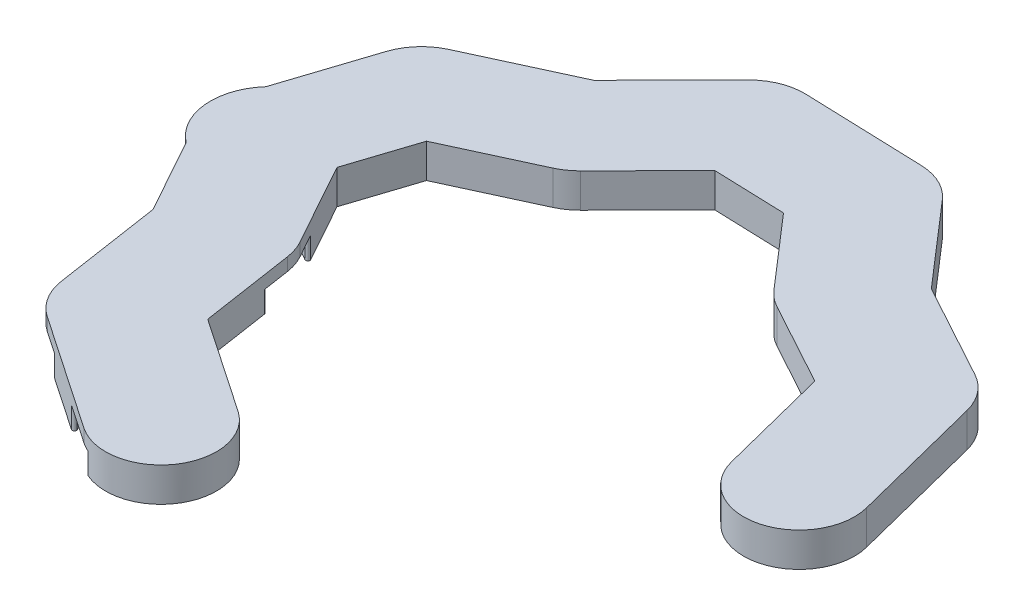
ISO-10303-21;
HEADER;
FILE_DESCRIPTION(('STEP AP214'),'2;1');
FILE_NAME('part.step','',(''),(''),'','','');
FILE_SCHEMA(('AUTOMOTIVE_DESIGN { 1 0 10303 214 1 1 1 1 }'));
ENDSEC;
DATA;
#1=APPLICATION_CONTEXT('core data for automotive mechanical design processes');
#2=APPLICATION_PROTOCOL_DEFINITION('international standard','automotive_design',2000,#1);
#3=PRODUCT_CONTEXT('',#1,'mechanical');
#4=PRODUCT('Part','Part','',(#3));
#5=PRODUCT_RELATED_PRODUCT_CATEGORY('part','',(#4));
#6=PRODUCT_DEFINITION_FORMATION('','',#4);
#7=PRODUCT_DEFINITION_CONTEXT('part definition',#1,'design');
#8=PRODUCT_DEFINITION('design','',#6,#7);
#9=PRODUCT_DEFINITION_SHAPE('','',#8);
#10=(LENGTH_UNIT() NAMED_UNIT(*) SI_UNIT(.MILLI.,.METRE.));
#11=(NAMED_UNIT(*) PLANE_ANGLE_UNIT() SI_UNIT($,.RADIAN.));
#12=(NAMED_UNIT(*) SI_UNIT($,.STERADIAN.) SOLID_ANGLE_UNIT());
#13=UNCERTAINTY_MEASURE_WITH_UNIT(LENGTH_MEASURE(1.E-05),#10,'distance_accuracy_value','');
#14=(GEOMETRIC_REPRESENTATION_CONTEXT(3) GLOBAL_UNCERTAINTY_ASSIGNED_CONTEXT((#13)) GLOBAL_UNIT_ASSIGNED_CONTEXT((#10,
#11,#12)) REPRESENTATION_CONTEXT('',''));
#15=CARTESIAN_POINT('',(0.,0.,0.));
#16=DIRECTION('',(0.,0.,1.));
#17=DIRECTION('',(1.,0.,0.));
#18=AXIS2_PLACEMENT_3D('',#15,#16,#17);
#19=CARTESIAN_POINT('',(-60.7942123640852,10.16,57.7049057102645));
#20=DIRECTION('',(0.,-1.,0.));
#21=DIRECTION('',(0.,0.,-1.));
#22=AXIS2_PLACEMENT_3D('',#19,#20,#21);
#23=CYLINDRICAL_SURFACE('',#22,16.5100000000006);
#24=CARTESIAN_POINT('',(-60.7942123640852,6.35,57.7049057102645));
#25=DIRECTION('',(0.,-1.,0.));
#26=DIRECTION('',(0.,0.,-1.));
#27=AXIS2_PLACEMENT_3D('',#24,#25,#26);
#28=CIRCLE('',#27,16.5100000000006);
#29=CARTESIAN_POINT('',(-70.0853332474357,6.35,71.3524392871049));
#30=VERTEX_POINT('',#29);
#31=CARTESIAN_POINT('',(-77.1185790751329,6.35,60.1737417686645));
#32=VERTEX_POINT('',#31);
#33=EDGE_CURVE('E1100',#30,#32,#28,.T.);
#34=ORIENTED_EDGE('',*,*,#33,.F.);
#35=DIRECTION('',(0.,-1.,0.));
#36=VECTOR('',#35,1.);
#37=CARTESIAN_POINT('',(-70.0853332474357,10.16,71.3524392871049));
#38=LINE('',#37,#36);
#39=CARTESIAN_POINT('',(-70.0853332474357,10.16,71.3524392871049));
#40=VERTEX_POINT('',#39);
#41=EDGE_CURVE('E499',#40,#30,#38,.T.);
#42=ORIENTED_EDGE('',*,*,#41,.F.);
#43=CARTESIAN_POINT('',(-60.7942123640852,10.16,57.7049057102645));
#44=DIRECTION('',(0.,1.,0.));
#45=DIRECTION('',(0.,0.,1.));
#46=AXIS2_PLACEMENT_3D('',#43,#44,#45);
#47=CIRCLE('',#46,16.5100000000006);
#48=CARTESIAN_POINT('',(-77.1185790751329,10.16,60.1737417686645));
#49=VERTEX_POINT('',#48);
#50=EDGE_CURVE('E890',#49,#40,#47,.T.);
#51=ORIENTED_EDGE('',*,*,#50,.F.);
#52=DIRECTION('',(0.,-1.,0.));
#53=VECTOR('',#52,1.);
#54=CARTESIAN_POINT('',(-77.1185790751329,10.16,60.1737417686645));
#55=LINE('',#54,#53);
#56=EDGE_CURVE('E502',#49,#32,#55,.T.);
#57=ORIENTED_EDGE('',*,*,#56,.T.);
#58=EDGE_LOOP('',(#34,#42,#51,#57));
#59=FACE_BOUND('',#58,.T.);
#60=ADVANCED_FACE('F34',(#59),#23,.T.);
#61=CARTESIAN_POINT('',(-66.1117054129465,10.16,22.5447312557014));
#62=DIRECTION('',(0.,-1.,0.));
#63=DIRECTION('',(0.,0.,-1.));
#64=AXIS2_PLACEMENT_3D('',#61,#62,#63);
#65=CYLINDRICAL_SURFACE('',#64,16.5100000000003);
#66=CARTESIAN_POINT('',(-66.1117054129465,6.35,22.5447312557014));
#67=DIRECTION('',(0.,-1.,0.));
#68=DIRECTION('',(0.,0.,-1.));
#69=AXIS2_PLACEMENT_3D('',#66,#67,#68);
#70=CIRCLE('',#69,16.5100000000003);
#71=CARTESIAN_POINT('',(-51.6800846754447,6.35,14.5254779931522));
#72=VERTEX_POINT('',#71);
#73=CARTESIAN_POINT('',(-49.7873387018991,6.35,20.0758951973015));
#74=VERTEX_POINT('',#73);
#75=EDGE_CURVE('E455',#72,#74,#70,.T.);
#76=ORIENTED_EDGE('',*,*,#75,.F.);
#77=DIRECTION('',(0.,-1.,0.));
#78=VECTOR('',#77,1.);
#79=CARTESIAN_POINT('',(-51.6800846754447,10.16,14.5254779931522));
#80=LINE('',#79,#78);
#81=CARTESIAN_POINT('',(-51.6800846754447,10.16,14.5254779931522));
#82=VERTEX_POINT('',#81);
#83=EDGE_CURVE('E472',#82,#72,#80,.T.);
#84=ORIENTED_EDGE('',*,*,#83,.F.);
#85=CARTESIAN_POINT('',(-66.1117054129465,10.16,22.5447312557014));
#86=DIRECTION('',(0.,1.,0.));
#87=DIRECTION('',(0.,0.,1.));
#88=AXIS2_PLACEMENT_3D('',#85,#86,#87);
#89=CIRCLE('',#88,16.5100000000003);
#90=CARTESIAN_POINT('',(-49.7873387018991,10.16,20.0758951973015));
#91=VERTEX_POINT('',#90);
#92=EDGE_CURVE('E900',#91,#82,#89,.T.);
#93=ORIENTED_EDGE('',*,*,#92,.F.);
#94=DIRECTION('',(0.,-1.,0.));
#95=VECTOR('',#94,1.);
#96=CARTESIAN_POINT('',(-49.7873387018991,10.16,20.0758951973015));
#97=LINE('',#96,#95);
#98=EDGE_CURVE('E475',#91,#74,#97,.T.);
#99=ORIENTED_EDGE('',*,*,#98,.T.);
#100=EDGE_LOOP('',(#76,#84,#93,#99));
#101=FACE_BOUND('',#100,.T.);
#102=ADVANCED_FACE('F470',(#101),#65,.T.);
#103=CARTESIAN_POINT('',(85.2050001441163,0.,2.7876216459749));
#104=DIRECTION('',(0.,1.,0.));
#105=DIRECTION('',(0.,0.,1.));
#106=AXIS2_PLACEMENT_3D('',#103,#104,#105);
#107=PLANE('',#106);
#108=CARTESIAN_POINT('',(-31.3995246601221,0.,77.7165506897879));
#109=DIRECTION('',(0.,1.,0.));
#110=DIRECTION('',(0.,0.,1.));
#111=AXIS2_PLACEMENT_3D('',#108,#109,#110);
#112=CIRCLE('',#111,17.272);
#113=CARTESIAN_POINT('',(-48.3374226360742,0.,74.3357821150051));
#114=VERTEX_POINT('',#113);
#115=CARTESIAN_POINT('',(-46.6223857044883,0.,85.876604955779));
#116=VERTEX_POINT('',#115);
#117=EDGE_CURVE('E465',#114,#116,#112,.T.);
#118=ORIENTED_EDGE('',*,*,#117,.T.);
#119=CARTESIAN_POINT('',(-47.1820497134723,0.,86.1766069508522));
#120=DIRECTION('',(0.,1.,0.));
#121=DIRECTION('',(0.,0.,1.));
#122=AXIS2_PLACEMENT_3D('',#119,#120,#121);
#123=CIRCLE('',#122,0.635);
#124=CARTESIAN_POINT('',(-47.5394005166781,0.,86.701512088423));
#125=VERTEX_POINT('',#124);
#126=EDGE_CURVE('E591',#116,#125,#123,.F.);
#127=ORIENTED_EDGE('',*,*,#126,.T.);
#128=DIRECTION('',(0.826622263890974,0.,0.562757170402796));
#129=VECTOR('',#128,1.);
#130=CARTESIAN_POINT('',(-70.0853332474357,0.,71.3524392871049));
#131=LINE('',#130,#129);
#132=CARTESIAN_POINT('',(-63.2365782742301,0.,76.0150114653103));
#133=VERTEX_POINT('',#132);
#134=EDGE_CURVE('E747',#133,#125,#131,.T.);
#135=ORIENTED_EDGE('',*,*,#134,.F.);
#136=CARTESIAN_POINT('',(-62.8792274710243,0.,75.4901063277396));
#137=DIRECTION('',(0.,1.,0.));
#138=DIRECTION('',(0.,0.,1.));
#139=AXIS2_PLACEMENT_3D('',#136,#137,#138);
#140=CIRCLE('',#139,0.635);
#141=CARTESIAN_POINT('',(-62.8052907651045,0.,74.8594254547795));
#142=VERTEX_POINT('',#141);
#143=EDGE_CURVE('E589',#133,#142,#140,.F.);
#144=ORIENTED_EDGE('',*,*,#143,.T.);
#145=CARTESIAN_POINT('',(-60.7942123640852,0.,57.7049057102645));
#146=DIRECTION('',(0.,-1.,0.));
#147=DIRECTION('',(0.,0.,-1.));
#148=AXIS2_PLACEMENT_3D('',#145,#146,#147);
#149=CIRCLE('',#148,17.272);
#150=CARTESIAN_POINT('',(-51.4392477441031,0.,72.2240868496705));
#151=VERTEX_POINT('',#150);
#152=EDGE_CURVE('E1071',#151,#142,#149,.T.);
#153=ORIENTED_EDGE('',*,*,#152,.F.);
#154=CARTESIAN_POINT('',(-51.0953152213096,0.,72.7578802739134));
#155=DIRECTION('',(0.,1.,0.));
#156=DIRECTION('',(0.,0.,1.));
#157=AXIS2_PLACEMENT_3D('',#154,#155,#156);
#158=CIRCLE('',#157,0.635);
#159=CARTESIAN_POINT('',(-50.7379644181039,0.,72.2329751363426));
#160=VERTEX_POINT('',#159);
#161=EDGE_CURVE('E587',#151,#160,#158,.F.);
#162=ORIENTED_EDGE('',*,*,#161,.T.);
#163=DIRECTION('',(-0.826622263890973,0.,-0.562757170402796));
#164=VECTOR('',#163,1.);
#165=CARTESIAN_POINT('',(-51.0902140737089,0.,71.993166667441));
#166=LINE('',#165,#164);
#167=CARTESIAN_POINT('',(-48.6027886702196,0.,73.6865840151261));
#168=VERTEX_POINT('',#167);
#169=EDGE_CURVE('E1091',#168,#160,#166,.T.);
#170=ORIENTED_EDGE('',*,*,#169,.F.);
#171=CARTESIAN_POINT('',(-48.9601394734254,0.,74.2114891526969));
#172=DIRECTION('',(0.,1.,0.));
#173=DIRECTION('',(0.,0.,1.));
#174=AXIS2_PLACEMENT_3D('',#171,#172,#173);
#175=CIRCLE('',#174,0.635);
#176=EDGE_CURVE('E585',#168,#114,#175,.F.);
#177=ORIENTED_EDGE('',*,*,#176,.T.);
#178=EDGE_LOOP('',(#118,#127,#135,#144,#153,#162,#170,#177));
#179=FACE_BOUND('',#178,.T.);
#180=ADVANCED_FACE('F928',(#179),#107,.F.);
#181=CARTESIAN_POINT('',(-26.5703973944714,0.,81.0041780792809));
#182=DIRECTION('',(0.,1.,0.));
#183=DIRECTION('',(0.,0.,1.));
#184=AXIS2_PLACEMENT_3D('',#181,#182,#183);
#185=CIRCLE('',#184,16.5100000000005);
#186=CARTESIAN_POINT('',(-33.1596048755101,0.,96.1422904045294));
#187=VERTEX_POINT('',#186);
#188=CARTESIAN_POINT('',(-14.9019339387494,0.,69.3239785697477));
#189=VERTEX_POINT('',#188);
#190=EDGE_CURVE('E755',#187,#189,#185,.T.);
#191=ORIENTED_EDGE('',*,*,#190,.F.);
#192=CARTESIAN_POINT('',(-32.9061738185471,0.,95.5600553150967));
#193=DIRECTION('',(0.,1.,0.));
#194=DIRECTION('',(0.,0.,1.));
#195=AXIS2_PLACEMENT_3D('',#192,#193,#194);
#196=CIRCLE('',#195,0.635);
#197=CARTESIAN_POINT('',(-32.8527465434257,0.,94.9273069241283));
#198=VERTEX_POINT('',#197);
#199=EDGE_CURVE('E570',#187,#198,#196,.F.);
#200=ORIENTED_EDGE('',*,*,#199,.T.);
#201=CARTESIAN_POINT('',(-15.9198275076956,0.,70.0548955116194));
#202=VERTEX_POINT('',#201);
#203=EDGE_CURVE('E551',#198,#202,#112,.T.);
#204=ORIENTED_EDGE('',*,*,#203,.T.);
#205=CARTESIAN_POINT('',(-15.3507209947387,0.,69.773217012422));
#206=DIRECTION('',(0.,1.,0.));
#207=DIRECTION('',(0.,0.,1.));
#208=AXIS2_PLACEMENT_3D('',#205,#206,#207);
#209=CIRCLE('',#208,0.635);
#210=EDGE_CURVE('E568',#202,#189,#209,.F.);
#211=ORIENTED_EDGE('',*,*,#210,.T.);
#212=EDGE_LOOP('',(#191,#200,#204,#211));
#213=FACE_BOUND('',#212,.T.);
#214=ADVANCED_FACE('F1215',(#213),#107,.F.);
#215=DIRECTION('',(-0.485720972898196,0.,-0.874113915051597));
#216=VECTOR('',#215,1.);
#217=CARTESIAN_POINT('',(-65.4526894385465,0.,-10.2599979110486));
#218=LINE('',#217,#216);
#219=CARTESIAN_POINT('',(-55.7043942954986,0.,7.28324380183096));
#220=VERTEX_POINT('',#219);
#221=CARTESIAN_POINT('',(-65.4526894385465,0.,-10.2599979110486));
#222=VERTEX_POINT('',#221);
#223=EDGE_CURVE('E763',#220,#222,#218,.T.);
#224=ORIENTED_EDGE('',*,*,#223,.F.);
#225=CARTESIAN_POINT('',(-56.2594566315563,0.,7.59167661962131));
#226=DIRECTION('',(0.,1.,0.));
#227=DIRECTION('',(0.,0.,1.));
#228=AXIS2_PLACEMENT_3D('',#225,#226,#227);
#229=CIRCLE('',#228,0.635);
#230=CARTESIAN_POINT('',(-56.6088271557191,0.,8.12192678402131));
#231=VERTEX_POINT('',#230);
#232=EDGE_CURVE('E674',#220,#231,#229,.F.);
#233=ORIENTED_EDGE('',*,*,#232,.T.);
#234=CARTESIAN_POINT('',(-66.1117054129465,0.,22.5447312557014));
#235=DIRECTION('',(0.,1.,0.));
#236=DIRECTION('',(0.,0.,1.));
#237=AXIS2_PLACEMENT_3D('',#234,#235,#236);
#238=CIRCLE('',#237,17.272);
#239=CARTESIAN_POINT('',(-83.3777908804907,0.,22.9967009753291));
#240=VERTEX_POINT('',#239);
#241=EDGE_CURVE('E548',#231,#240,#238,.T.);
#242=ORIENTED_EDGE('',*,*,#241,.T.);
#243=CARTESIAN_POINT('',(-84.0125734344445,0.,23.013317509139));
#244=DIRECTION('',(0.,1.,0.));
#245=DIRECTION('',(0.,0.,1.));
#246=AXIS2_PLACEMENT_3D('',#243,#244,#245);
#247=CIRCLE('',#246,0.635);
#248=CARTESIAN_POINT('',(-84.5676357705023,0.,23.3217503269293));
#249=VERTEX_POINT('',#248);
#250=EDGE_CURVE('E672',#240,#249,#247,.F.);
#251=ORIENTED_EDGE('',*,*,#250,.T.);
#252=DIRECTION('',(0.485720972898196,0.,0.874113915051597));
#253=VECTOR('',#252,1.);
#254=CARTESIAN_POINT('',(-94.3159309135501,0.,5.77850861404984));
#255=LINE('',#254,#253);
#256=CARTESIAN_POINT('',(-94.3159309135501,0.,5.77850861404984));
#257=VERTEX_POINT('',#256);
#258=EDGE_CURVE('E738',#257,#249,#255,.T.);
#259=ORIENTED_EDGE('',*,*,#258,.F.);
#260=CARTESIAN_POINT('',(-83.3839432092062,0.,-8.53875956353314));
#261=DIRECTION('',(0.,1.,0.));
#262=DIRECTION('',(0.,0.,1.));
#263=AXIS2_PLACEMENT_3D('',#260,#261,#262);
#264=CIRCLE('',#263,18.0136760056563);
#265=CARTESIAN_POINT('',(-96.8398709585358,0.,-20.5150082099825));
#266=VERTEX_POINT('',#265);
#267=EDGE_CURVE('E744',#266,#257,#264,.T.);
#268=ORIENTED_EDGE('',*,*,#267,.F.);
#269=DIRECTION('',(-0.310569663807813,0.,0.950550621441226));
#270=VECTOR('',#269,1.);
#271=CARTESIAN_POINT('',(-96.8398709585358,0.,-20.5150082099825));
#272=LINE('',#271,#270);
#273=CARTESIAN_POINT('',(-88.0336767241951,0.,-47.4678448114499));
#274=VERTEX_POINT('',#273);
#275=EDGE_CURVE('E749',#274,#266,#272,.T.);
#276=ORIENTED_EDGE('',*,*,#275,.F.);
#277=CARTESIAN_POINT('',(-72.3400859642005,0.,-42.340339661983));
#278=DIRECTION('',(0.,1.,0.));
#279=DIRECTION('',(0.,0.,1.));
#280=AXIS2_PLACEMENT_3D('',#277,#278,#279);
#281=CIRCLE('',#280,16.5099999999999);
#282=CARTESIAN_POINT('',(-79.2529829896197,0.,-57.3334032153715));
#283=VERTEX_POINT('',#282);
#284=EDGE_CURVE('E868',#283,#274,#281,.T.);
#285=ORIENTED_EDGE('',*,*,#284,.F.);
#286=DIRECTION('',(-0.908120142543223,0.,0.418709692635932));
#287=VECTOR('',#286,1.);
#288=CARTESIAN_POINT('',(-79.2529829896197,0.,-57.3334032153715));
#289=LINE('',#288,#287);
#290=CARTESIAN_POINT('',(-49.6659724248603,0.,-70.975175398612));
#291=VERTEX_POINT('',#290);
#292=EDGE_CURVE('E866',#291,#283,#289,.T.);
#293=ORIENTED_EDGE('',*,*,#292,.F.);
#294=DIRECTION('',(-0.704475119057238,0.,0.70972868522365));
#295=VECTOR('',#294,1.);
#296=CARTESIAN_POINT('',(-26.7138190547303,0.,-94.0984925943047));
#297=LINE('',#296,#295);
#298=CARTESIAN_POINT('',(-26.7138190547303,0.,-94.0984925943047));
#299=VERTEX_POINT('',#298);
#300=EDGE_CURVE('E864',#299,#291,#297,.T.);
#301=ORIENTED_EDGE('',*,*,#300,.F.);
#302=CARTESIAN_POINT('',(-14.9961984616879,0.,-82.4676083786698));
#303=DIRECTION('',(0.,1.,0.));
#304=DIRECTION('',(0.,0.,1.));
#305=AXIS2_PLACEMENT_3D('',#302,#303,#304);
#306=CIRCLE('',#305,16.51);
#307=CARTESIAN_POINT('',(-14.4371603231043,0.,-98.9681409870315));
#308=VERTEX_POINT('',#307);
#309=EDGE_CURVE('E862',#308,#299,#306,.T.);
#310=ORIENTED_EDGE('',*,*,#309,.F.);
#311=DIRECTION('',(-0.999426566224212,0.,-0.0338605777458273));
#312=VECTOR('',#311,1.);
#313=CARTESIAN_POINT('',(-14.4371603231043,0.,-98.9681409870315));
#314=LINE('',#313,#312);
#315=CARTESIAN_POINT('',(21.1024483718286,0.,-97.7640588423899));
#316=VERTEX_POINT('',#315);
#317=EDGE_CURVE('E860',#316,#308,#314,.T.);
#318=ORIENTED_EDGE('',*,*,#317,.F.);
#319=CARTESIAN_POINT('',(20.5434102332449,0.,-81.2635262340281));
#320=DIRECTION('',(0.,1.,0.));
#321=DIRECTION('',(0.,0.,1.));
#322=AXIS2_PLACEMENT_3D('',#319,#320,#321);
#323=CIRCLE('',#322,16.51);
#324=CARTESIAN_POINT('',(33.0213666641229,0.,-92.0746641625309));
#325=VERTEX_POINT('',#324);
#326=EDGE_CURVE('E858',#325,#316,#323,.T.);
#327=ORIENTED_EDGE('',*,*,#326,.F.);
#328=DIRECTION('',(-0.654823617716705,0.,-0.755781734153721));
#329=VECTOR('',#328,1.);
#330=CARTESIAN_POINT('',(33.0213666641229,0.,-92.0746641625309));
#331=LINE('',#330,#329);
#332=CARTESIAN_POINT('',(54.3558491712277,0.,-67.4509154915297));
#333=VERTEX_POINT('',#332);
#334=EDGE_CURVE('E856',#333,#325,#331,.T.);
#335=ORIENTED_EDGE('',*,*,#334,.F.);
#336=DIRECTION('',(-0.877698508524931,0.,-0.479213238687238));
#337=VECTOR('',#336,1.);
#338=CARTESIAN_POINT('',(54.3558491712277,0.,-67.4509154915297));
#339=LINE('',#338,#337);
#340=CARTESIAN_POINT('',(82.9517076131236,0.,-51.8379073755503));
#341=VERTEX_POINT('',#340);
#342=EDGE_CURVE('E854',#341,#333,#339,.T.);
#343=ORIENTED_EDGE('',*,*,#342,.F.);
#344=CARTESIAN_POINT('',(75.0398970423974,0.,-37.3471049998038));
#345=DIRECTION('',(0.,1.,0.));
#346=DIRECTION('',(0.,0.,1.));
#347=AXIS2_PLACEMENT_3D('',#344,#345,#346);
#348=CIRCLE('',#347,16.51);
#349=CARTESIAN_POINT('',(91.04454263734,0.,-41.4006737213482));
#350=VERTEX_POINT('',#349);
#351=EDGE_CURVE('E852',#350,#341,#348,.T.);
#352=ORIENTED_EDGE('',*,*,#351,.F.);
#353=DIRECTION('',(-0.245522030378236,0.,-0.969391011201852));
#354=VECTOR('',#353,1.);
#355=CARTESIAN_POINT('',(91.04454263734,0.,-41.4006737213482));
#356=LINE('',#355,#354);
#357=CARTESIAN_POINT('',(101.20964573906,0.,-1.26594707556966));
#358=VERTEX_POINT('',#357);
#359=EDGE_CURVE('E850',#358,#350,#356,.T.);
#360=ORIENTED_EDGE('',*,*,#359,.F.);
#361=CARTESIAN_POINT('',(85.2050001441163,0.,2.7876216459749));
#362=DIRECTION('',(0.,1.,0.));
#363=DIRECTION('',(0.,0.,1.));
#364=AXIS2_PLACEMENT_3D('',#361,#362,#363);
#365=CIRCLE('',#364,16.5100000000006);
#366=CARTESIAN_POINT('',(69.2003545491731,0.,6.84119036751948));
#367=VERTEX_POINT('',#366);
#368=EDGE_CURVE('E847',#367,#358,#365,.T.);
#369=ORIENTED_EDGE('',*,*,#368,.F.);
#370=DIRECTION('',(0.245522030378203,0.,0.96939101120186));
#371=VECTOR('',#370,1.);
#372=CARTESIAN_POINT('',(60.8042444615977,0.,-26.3090472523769));
#373=LINE('',#372,#371);
#374=CARTESIAN_POINT('',(60.8042444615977,0.,-26.3090472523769));
#375=VERTEX_POINT('',#374);
#376=EDGE_CURVE('E781',#375,#367,#373,.T.);
#377=ORIENTED_EDGE('',*,*,#376,.F.);
#378=DIRECTION('',(0.877698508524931,0.,0.479213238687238));
#379=VECTOR('',#378,1.);
#380=CARTESIAN_POINT('',(35.9171275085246,0.,-39.8971253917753));
#381=LINE('',#380,#379);
#382=CARTESIAN_POINT('',(35.9171275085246,0.,-39.8971253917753));
#383=VERTEX_POINT('',#382);
#384=EDGE_CURVE('E779',#383,#375,#381,.T.);
#385=ORIENTED_EDGE('',*,*,#384,.F.);
#386=CARTESIAN_POINT('',(43.8289380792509,0.,-54.3879277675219));
#387=DIRECTION('',(0.,1.,0.));
#388=DIRECTION('',(0.,0.,1.));
#389=AXIS2_PLACEMENT_3D('',#386,#387,#388);
#390=CIRCLE('',#389,16.51);
#391=CARTESIAN_POINT('',(31.350981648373,0.,-43.5767898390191));
#392=VERTEX_POINT('',#391);
#393=EDGE_CURVE('E777',#392,#383,#390,.T.);
#394=ORIENTED_EDGE('',*,*,#393,.F.);
#395=DIRECTION('',(0.654823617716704,0.,0.755781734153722));
#396=VECTOR('',#395,1.);
#397=CARTESIAN_POINT('',(12.7834760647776,0.,-65.0069600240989));
#398=LINE('',#397,#396);
#399=CARTESIAN_POINT('',(12.7834760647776,0.,-65.0069600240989));
#400=VERTEX_POINT('',#399);
#401=EDGE_CURVE('E775',#400,#392,#398,.T.);
#402=ORIENTED_EDGE('',*,*,#401,.F.);
#403=DIRECTION('',(0.999426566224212,0.,0.0338605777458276));
#404=VECTOR('',#403,1.);
#405=CARTESIAN_POINT('',(12.7834760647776,0.,-65.0069600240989));
#406=LINE('',#405,#404);
#407=CARTESIAN_POINT('',(-8.3543405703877,0.,-65.7231093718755));
#408=VERTEX_POINT('',#407);
#409=EDGE_CURVE('E773',#408,#400,#406,.T.);
#410=ORIENTED_EDGE('',*,*,#409,.F.);
#411=DIRECTION('',(0.704475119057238,0.,-0.70972868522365));
#412=VECTOR('',#411,1.);
#413=CARTESIAN_POINT('',(-28.3297131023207,0.,-45.5987721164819));
#414=LINE('',#413,#412);
#415=CARTESIAN_POINT('',(-28.3297131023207,0.,-45.5987721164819));
#416=VERTEX_POINT('',#415);
#417=EDGE_CURVE('E771',#416,#408,#414,.T.);
#418=ORIENTED_EDGE('',*,*,#417,.F.);
#419=CARTESIAN_POINT('',(-40.0473336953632,0.,-57.2296563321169));
#420=DIRECTION('',(0.,1.,0.));
#421=DIRECTION('',(0.,0.,1.));
#422=AXIS2_PLACEMENT_3D('',#419,#420,#421);
#423=CIRCLE('',#422,16.51);
#424=CARTESIAN_POINT('',(-33.134436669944,0.,-42.2365927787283));
#425=VERTEX_POINT('',#424);
#426=EDGE_CURVE('E769',#425,#416,#423,.T.);
#427=ORIENTED_EDGE('',*,*,#426,.F.);
#428=DIRECTION('',(0.908120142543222,0.,-0.418709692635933));
#429=VECTOR('',#428,1.);
#430=CARTESIAN_POINT('',(-33.1344366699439,0.,-42.2365927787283));
#431=LINE('',#430,#429);
#432=CARTESIAN_POINT('',(-58.8841582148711,0.,-30.3640910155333));
#433=VERTEX_POINT('',#432);
#434=EDGE_CURVE('E767',#433,#425,#431,.T.);
#435=ORIENTED_EDGE('',*,*,#434,.F.);
#436=DIRECTION('',(0.310569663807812,0.,-0.950550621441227));
#437=VECTOR('',#436,1.);
#438=CARTESIAN_POINT('',(-58.8841582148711,0.,-30.3640910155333));
#439=LINE('',#438,#437);
#440=EDGE_CURVE('E765',#222,#433,#439,.T.);
#441=ORIENTED_EDGE('',*,*,#440,.F.);
#442=EDGE_LOOP('',(#224,#233,#242,#251,#259,#268,#276,#285,#293,#301,#310,#318,#327,#335,#343,
#352,#360,#369,#377,#385,#394,#402,#410,#418,#427,#435,#441));
#443=FACE_BOUND('',#442,.T.);
#444=ADVANCED_FACE('F736',(#443),#107,.F.);
#445=CARTESIAN_POINT('',(-31.3995246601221,0.,77.7165506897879));
#446=DIRECTION('',(0.,-1.,0.));
#447=DIRECTION('',(0.,0.,-1.));
#448=AXIS2_PLACEMENT_3D('',#445,#446,#447);
#449=CIRCLE('',#448,17.272);
#450=CARTESIAN_POINT('',(-40.7544892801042,0.,63.1973695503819));
#451=VERTEX_POINT('',#450);
#452=CARTESIAN_POINT('',(-29.3884462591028,0.,60.562030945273));
#453=VERTEX_POINT('',#452);
#454=EDGE_CURVE('E1088',#451,#453,#449,.T.);
#455=ORIENTED_EDGE('',*,*,#454,.F.);
#456=CARTESIAN_POINT('',(-41.0984218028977,0.,62.663576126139));
#457=DIRECTION('',(0.,1.,0.));
#458=DIRECTION('',(0.,0.,1.));
#459=AXIS2_PLACEMENT_3D('',#456,#457,#458);
#460=CIRCLE('',#459,0.635);
#461=CARTESIAN_POINT('',(-41.4557726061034,0.,63.1884812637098));
#462=VERTEX_POINT('',#461);
#463=EDGE_CURVE('E646',#451,#462,#460,.F.);
#464=ORIENTED_EDGE('',*,*,#463,.T.);
#465=DIRECTION('',(0.826622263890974,0.,0.562757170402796));
#466=VECTOR('',#465,1.);
#467=CARTESIAN_POINT('',(-41.1035229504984,0.,63.4282897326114));
#468=LINE('',#467,#466);
#469=CARTESIAN_POINT('',(-43.5909483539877,0.,61.7348723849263));
#470=VERTEX_POINT('',#469);
#471=EDGE_CURVE('E1085',#470,#462,#468,.T.);
#472=ORIENTED_EDGE('',*,*,#471,.F.);
#473=CARTESIAN_POINT('',(-43.2335975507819,0.,61.2099672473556));
#474=DIRECTION('',(0.,1.,0.));
#475=DIRECTION('',(0.,0.,1.));
#476=AXIS2_PLACEMENT_3D('',#473,#474,#475);
#477=CIRCLE('',#476,0.635);
#478=CARTESIAN_POINT('',(-43.8563143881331,0.,61.0856742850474));
#479=VERTEX_POINT('',#478);
#480=EDGE_CURVE('E638',#470,#479,#477,.F.);
#481=ORIENTED_EDGE('',*,*,#480,.T.);
#482=CARTESIAN_POINT('',(-60.7942123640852,0.,57.7049057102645));
#483=DIRECTION('',(0.,-1.,0.));
#484=DIRECTION('',(0.,0.,-1.));
#485=AXIS2_PLACEMENT_3D('',#482,#483,#484);
#486=CIRCLE('',#485,17.272);
#487=CARTESIAN_POINT('',(-56.510846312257,0.,40.9724594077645));
#488=VERTEX_POINT('',#487);
#489=EDGE_CURVE('E1083',#488,#479,#486,.T.);
#490=ORIENTED_EDGE('',*,*,#489,.F.);
#491=CARTESIAN_POINT('',(-56.353369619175,0.,40.3572959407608));
#492=DIRECTION('',(0.,1.,0.));
#493=DIRECTION('',(0.,0.,1.));
#494=AXIS2_PLACEMENT_3D('',#491,#492,#493);
#495=CIRCLE('',#494,0.635);
#496=CARTESIAN_POINT('',(-56.9812298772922,0.,40.4522511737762));
#497=VERTEX_POINT('',#496);
#498=EDGE_CURVE('E640',#488,#497,#495,.F.);
#499=ORIENTED_EDGE('',*,*,#498,.T.);
#500=DIRECTION('',(0.149535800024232,0.,0.988756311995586));
#501=VECTOR('',#500,1.);
#502=CARTESIAN_POINT('',(-56.9175079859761,0.,40.8735912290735));
#503=LINE('',#502,#501);
#504=CARTESIAN_POINT('',(-57.3674827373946,0.,37.898281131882));
#505=VERTEX_POINT('',#504);
#506=EDGE_CURVE('E1080',#505,#497,#503,.T.);
#507=ORIENTED_EDGE('',*,*,#506,.F.);
#508=CARTESIAN_POINT('',(-56.7396224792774,0.,37.8033258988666));
#509=DIRECTION('',(0.,1.,0.));
#510=DIRECTION('',(0.,0.,1.));
#511=AXIS2_PLACEMENT_3D('',#508,#509,#510);
#512=CIRCLE('',#511,0.635);
#513=CARTESIAN_POINT('',(-57.0719658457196,0.,37.2622409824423));
#514=VERTEX_POINT('',#513);
#515=EDGE_CURVE('E642',#505,#514,#512,.F.);
#516=ORIENTED_EDGE('',*,*,#515,.T.);
#517=CARTESIAN_POINT('',(-49.776808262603,0.,28.1566043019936));
#518=VERTEX_POINT('',#517);
#519=EDGE_CURVE('E552',#514,#518,#238,.T.);
#520=ORIENTED_EDGE('',*,*,#519,.T.);
#521=CARTESIAN_POINT('',(-49.1762605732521,0.,28.3629231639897));
#522=DIRECTION('',(0.,1.,0.));
#523=DIRECTION('',(0.,0.,1.));
#524=AXIS2_PLACEMENT_3D('',#521,#522,#523);
#525=CIRCLE('',#524,0.635);
#526=CARTESIAN_POINT('',(-48.5484003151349,0.,28.2679679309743));
#527=VERTEX_POINT('',#526);
#528=EDGE_CURVE('E636',#518,#527,#525,.F.);
#529=ORIENTED_EDGE('',*,*,#528,.T.);
#530=DIRECTION('',(-0.149535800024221,0.,-0.988756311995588));
#531=VECTOR('',#530,1.);
#532=CARTESIAN_POINT('',(-49.7873387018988,0.,20.0758951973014));
#533=LINE('',#532,#531);
#534=CARTESIAN_POINT('',(-45.5472552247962,0.,48.1120530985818));
#535=VERTEX_POINT('',#534);
#536=EDGE_CURVE('E760',#535,#527,#533,.T.);
#537=ORIENTED_EDGE('',*,*,#536,.F.);
#538=DIRECTION('',(-0.826622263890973,0.,-0.562757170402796));
#539=VECTOR('',#538,1.);
#540=CARTESIAN_POINT('',(-17.279276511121,0.,67.3566445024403));
#541=LINE('',#540,#539);
#542=CARTESIAN_POINT('',(-28.9571587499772,0.,59.4064449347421));
#543=VERTEX_POINT('',#542);
#544=EDGE_CURVE('E758',#543,#535,#541,.T.);
#545=ORIENTED_EDGE('',*,*,#544,.F.);
#546=CARTESIAN_POINT('',(-29.3145095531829,0.,59.9313500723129));
#547=DIRECTION('',(0.,1.,0.));
#548=DIRECTION('',(0.,0.,1.));
#549=AXIS2_PLACEMENT_3D('',#546,#547,#548);
#550=CIRCLE('',#549,0.635);
#551=EDGE_CURVE('E644',#543,#453,#550,.F.);
#552=ORIENTED_EDGE('',*,*,#551,.T.);
#553=EDGE_LOOP('',(#455,#464,#472,#481,#490,#499,#507,#516,#520,#529,#537,#545,#552));
#554=FACE_BOUND('',#553,.T.);
#555=ADVANCED_FACE('F988',(#554),#107,.F.);
#556=CARTESIAN_POINT('',(85.2050001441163,10.16,2.7876216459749));
#557=DIRECTION('',(0.,-1.,0.));
#558=DIRECTION('',(0.,0.,-1.));
#559=AXIS2_PLACEMENT_3D('',#556,#557,#558);
#560=CYLINDRICAL_SURFACE('',#559,16.5100000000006);
#561=ORIENTED_EDGE('',*,*,#368,.T.);
#562=DIRECTION('',(0.,-1.,0.));
#563=VECTOR('',#562,1.);
#564=CARTESIAN_POINT('',(101.20964573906,10.16,-1.26594707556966));
#565=LINE('',#564,#563);
#566=CARTESIAN_POINT('',(101.20964573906,10.16,-1.26594707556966));
#567=VERTEX_POINT('',#566);
#568=EDGE_CURVE('E544',#567,#358,#565,.T.);
#569=ORIENTED_EDGE('',*,*,#568,.F.);
#570=CARTESIAN_POINT('',(85.2050001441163,10.16,2.7876216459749));
#571=DIRECTION('',(0.,1.,0.));
#572=DIRECTION('',(0.,0.,1.));
#573=AXIS2_PLACEMENT_3D('',#570,#571,#572);
#574=CIRCLE('',#573,16.5100000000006);
#575=CARTESIAN_POINT('',(69.2003545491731,10.16,6.84119036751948));
#576=VERTEX_POINT('',#575);
#577=EDGE_CURVE('E783',#576,#567,#574,.T.);
#578=ORIENTED_EDGE('',*,*,#577,.F.);
#579=DIRECTION('',(0.,-1.,0.));
#580=VECTOR('',#579,1.);
#581=CARTESIAN_POINT('',(69.2003545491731,10.16,6.84119036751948));
#582=LINE('',#581,#580);
#583=EDGE_CURVE('E784',#576,#367,#582,.T.);
#584=ORIENTED_EDGE('',*,*,#583,.T.);
#585=EDGE_LOOP('',(#561,#569,#578,#584));
#586=FACE_BOUND('',#585,.T.);
#587=ADVANCED_FACE('F984',(#586),#560,.T.);
#588=CARTESIAN_POINT('',(91.04454263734,10.16,-41.4006737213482));
#589=DIRECTION('',(-0.969391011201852,0.,0.245522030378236));
#590=DIRECTION('',(0.245522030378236,0.,0.969391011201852));
#591=AXIS2_PLACEMENT_3D('',#588,#589,#590);
#592=PLANE('',#591);
#593=ORIENTED_EDGE('',*,*,#359,.T.);
#594=DIRECTION('',(0.,-1.,0.));
#595=VECTOR('',#594,1.);
#596=CARTESIAN_POINT('',(91.04454263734,10.16,-41.4006737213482));
#597=LINE('',#596,#595);
#598=CARTESIAN_POINT('',(91.04454263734,10.16,-41.4006737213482));
#599=VERTEX_POINT('',#598);
#600=EDGE_CURVE('E541',#599,#350,#597,.T.);
#601=ORIENTED_EDGE('',*,*,#600,.F.);
#602=DIRECTION('',(-0.245522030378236,0.,-0.969391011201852));
#603=VECTOR('',#602,1.);
#604=CARTESIAN_POINT('',(91.04454263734,10.16,-41.4006737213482));
#605=LINE('',#604,#603);
#606=EDGE_CURVE('E1107',#567,#599,#605,.T.);
#607=ORIENTED_EDGE('',*,*,#606,.F.);
#608=ORIENTED_EDGE('',*,*,#568,.T.);
#609=EDGE_LOOP('',(#593,#601,#607,#608));
#610=FACE_BOUND('',#609,.T.);
#611=ADVANCED_FACE('F980',(#610),#592,.F.);
#612=CARTESIAN_POINT('',(75.0398970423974,10.16,-37.3471049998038));
#613=DIRECTION('',(0.,-1.,0.));
#614=DIRECTION('',(0.,0.,-1.));
#615=AXIS2_PLACEMENT_3D('',#612,#613,#614);
#616=CYLINDRICAL_SURFACE('',#615,16.51);
#617=ORIENTED_EDGE('',*,*,#351,.T.);
#618=DIRECTION('',(0.,-1.,0.));
#619=VECTOR('',#618,1.);
#620=CARTESIAN_POINT('',(82.9517076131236,10.16,-51.8379073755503));
#621=LINE('',#620,#619);
#622=CARTESIAN_POINT('',(82.9517076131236,10.16,-51.8379073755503));
#623=VERTEX_POINT('',#622);
#624=EDGE_CURVE('E538',#623,#341,#621,.T.);
#625=ORIENTED_EDGE('',*,*,#624,.F.);
#626=CARTESIAN_POINT('',(75.0398970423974,10.16,-37.3471049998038));
#627=DIRECTION('',(0.,1.,0.));
#628=DIRECTION('',(0.,0.,1.));
#629=AXIS2_PLACEMENT_3D('',#626,#627,#628);
#630=CIRCLE('',#629,16.51);
#631=EDGE_CURVE('E1109',#599,#623,#630,.T.);
#632=ORIENTED_EDGE('',*,*,#631,.F.);
#633=ORIENTED_EDGE('',*,*,#600,.T.);
#634=EDGE_LOOP('',(#617,#625,#632,#633));
#635=FACE_BOUND('',#634,.T.);
#636=ADVANCED_FACE('F976',(#635),#616,.T.);
#637=CARTESIAN_POINT('',(54.3558491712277,10.16,-67.4509154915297));
#638=DIRECTION('',(-0.479213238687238,0.,0.877698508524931));
#639=DIRECTION('',(0.877698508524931,0.,0.479213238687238));
#640=AXIS2_PLACEMENT_3D('',#637,#638,#639);
#641=PLANE('',#640);
#642=ORIENTED_EDGE('',*,*,#342,.T.);
#643=DIRECTION('',(0.,-1.,0.));
#644=VECTOR('',#643,1.);
#645=CARTESIAN_POINT('',(54.3558491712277,10.16,-67.4509154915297));
#646=LINE('',#645,#644);
#647=CARTESIAN_POINT('',(54.3558491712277,10.16,-67.4509154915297));
#648=VERTEX_POINT('',#647);
#649=EDGE_CURVE('E535',#648,#333,#646,.T.);
#650=ORIENTED_EDGE('',*,*,#649,.F.);
#651=DIRECTION('',(-0.877698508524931,0.,-0.479213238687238));
#652=VECTOR('',#651,1.);
#653=CARTESIAN_POINT('',(54.3558491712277,10.16,-67.4509154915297));
#654=LINE('',#653,#652);
#655=EDGE_CURVE('E1111',#623,#648,#654,.T.);
#656=ORIENTED_EDGE('',*,*,#655,.F.);
#657=ORIENTED_EDGE('',*,*,#624,.T.);
#658=EDGE_LOOP('',(#642,#650,#656,#657));
#659=FACE_BOUND('',#658,.T.);
#660=ADVANCED_FACE('F972',(#659),#641,.F.);
#661=CARTESIAN_POINT('',(33.0213666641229,10.16,-92.0746641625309));
#662=DIRECTION('',(-0.755781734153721,0.,0.654823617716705));
#663=DIRECTION('',(0.654823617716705,0.,0.755781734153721));
#664=AXIS2_PLACEMENT_3D('',#661,#662,#663);
#665=PLANE('',#664);
#666=ORIENTED_EDGE('',*,*,#334,.T.);
#667=DIRECTION('',(0.,-1.,0.));
#668=VECTOR('',#667,1.);
#669=CARTESIAN_POINT('',(33.0213666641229,10.16,-92.0746641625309));
#670=LINE('',#669,#668);
#671=CARTESIAN_POINT('',(33.0213666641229,10.16,-92.0746641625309));
#672=VERTEX_POINT('',#671);
#673=EDGE_CURVE('E532',#672,#325,#670,.T.);
#674=ORIENTED_EDGE('',*,*,#673,.F.);
#675=DIRECTION('',(-0.654823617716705,0.,-0.755781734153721));
#676=VECTOR('',#675,1.);
#677=CARTESIAN_POINT('',(33.0213666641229,10.16,-92.0746641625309));
#678=LINE('',#677,#676);
#679=EDGE_CURVE('E1113',#648,#672,#678,.T.);
#680=ORIENTED_EDGE('',*,*,#679,.F.);
#681=ORIENTED_EDGE('',*,*,#649,.T.);
#682=EDGE_LOOP('',(#666,#674,#680,#681));
#683=FACE_BOUND('',#682,.T.);
#684=ADVANCED_FACE('F968',(#683),#665,.F.);
#685=CARTESIAN_POINT('',(20.5434102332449,10.16,-81.2635262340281));
#686=DIRECTION('',(0.,-1.,0.));
#687=DIRECTION('',(0.,0.,-1.));
#688=AXIS2_PLACEMENT_3D('',#685,#686,#687);
#689=CYLINDRICAL_SURFACE('',#688,16.51);
#690=ORIENTED_EDGE('',*,*,#326,.T.);
#691=DIRECTION('',(0.,-1.,0.));
#692=VECTOR('',#691,1.);
#693=CARTESIAN_POINT('',(21.1024483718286,10.16,-97.7640588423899));
#694=LINE('',#693,#692);
#695=CARTESIAN_POINT('',(21.1024483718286,10.16,-97.7640588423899));
#696=VERTEX_POINT('',#695);
#697=EDGE_CURVE('E529',#696,#316,#694,.T.);
#698=ORIENTED_EDGE('',*,*,#697,.F.);
#699=CARTESIAN_POINT('',(20.5434102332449,10.16,-81.2635262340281));
#700=DIRECTION('',(0.,1.,0.));
#701=DIRECTION('',(0.,0.,1.));
#702=AXIS2_PLACEMENT_3D('',#699,#700,#701);
#703=CIRCLE('',#702,16.51);
#704=EDGE_CURVE('E1115',#672,#696,#703,.T.);
#705=ORIENTED_EDGE('',*,*,#704,.F.);
#706=ORIENTED_EDGE('',*,*,#673,.T.);
#707=EDGE_LOOP('',(#690,#698,#705,#706));
#708=FACE_BOUND('',#707,.T.);
#709=ADVANCED_FACE('F964',(#708),#689,.T.);
#710=CARTESIAN_POINT('',(-14.4371603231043,10.16,-98.9681409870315));
#711=DIRECTION('',(-0.0338605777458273,0.,0.999426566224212));
#712=DIRECTION('',(0.999426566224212,0.,0.0338605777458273));
#713=AXIS2_PLACEMENT_3D('',#710,#711,#712);
#714=PLANE('',#713);
#715=ORIENTED_EDGE('',*,*,#317,.T.);
#716=DIRECTION('',(0.,-1.,0.));
#717=VECTOR('',#716,1.);
#718=CARTESIAN_POINT('',(-14.4371603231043,10.16,-98.9681409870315));
#719=LINE('',#718,#717);
#720=CARTESIAN_POINT('',(-14.4371603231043,10.16,-98.9681409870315));
#721=VERTEX_POINT('',#720);
#722=EDGE_CURVE('E526',#721,#308,#719,.T.);
#723=ORIENTED_EDGE('',*,*,#722,.F.);
#724=DIRECTION('',(-0.999426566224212,0.,-0.0338605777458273));
#725=VECTOR('',#724,1.);
#726=CARTESIAN_POINT('',(-14.4371603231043,10.16,-98.9681409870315));
#727=LINE('',#726,#725);
#728=EDGE_CURVE('E1117',#696,#721,#727,.T.);
#729=ORIENTED_EDGE('',*,*,#728,.F.);
#730=ORIENTED_EDGE('',*,*,#697,.T.);
#731=EDGE_LOOP('',(#715,#723,#729,#730));
#732=FACE_BOUND('',#731,.T.);
#733=ADVANCED_FACE('F960',(#732),#714,.F.);
#734=CARTESIAN_POINT('',(-14.9961984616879,10.16,-82.4676083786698));
#735=DIRECTION('',(0.,-1.,0.));
#736=DIRECTION('',(0.,0.,-1.));
#737=AXIS2_PLACEMENT_3D('',#734,#735,#736);
#738=CYLINDRICAL_SURFACE('',#737,16.51);
#739=ORIENTED_EDGE('',*,*,#309,.T.);
#740=DIRECTION('',(0.,-1.,0.));
#741=VECTOR('',#740,1.);
#742=CARTESIAN_POINT('',(-26.7138190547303,10.16,-94.0984925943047));
#743=LINE('',#742,#741);
#744=CARTESIAN_POINT('',(-26.7138190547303,10.16,-94.0984925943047));
#745=VERTEX_POINT('',#744);
#746=EDGE_CURVE('E523',#745,#299,#743,.T.);
#747=ORIENTED_EDGE('',*,*,#746,.F.);
#748=CARTESIAN_POINT('',(-14.9961984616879,10.16,-82.4676083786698));
#749=DIRECTION('',(0.,1.,0.));
#750=DIRECTION('',(0.,0.,1.));
#751=AXIS2_PLACEMENT_3D('',#748,#749,#750);
#752=CIRCLE('',#751,16.51);
#753=EDGE_CURVE('E1119',#721,#745,#752,.T.);
#754=ORIENTED_EDGE('',*,*,#753,.F.);
#755=ORIENTED_EDGE('',*,*,#722,.T.);
#756=EDGE_LOOP('',(#739,#747,#754,#755));
#757=FACE_BOUND('',#756,.T.);
#758=ADVANCED_FACE('F956',(#757),#738,.T.);
#759=CARTESIAN_POINT('',(-26.7138190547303,10.16,-94.0984925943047));
#760=DIRECTION('',(0.70972868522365,0.,0.704475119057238));
#761=DIRECTION('',(0.704475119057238,0.,-0.70972868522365));
#762=AXIS2_PLACEMENT_3D('',#759,#760,#761);
#763=PLANE('',#762);
#764=ORIENTED_EDGE('',*,*,#300,.T.);
#765=DIRECTION('',(0.,-1.,0.));
#766=VECTOR('',#765,1.);
#767=CARTESIAN_POINT('',(-49.6659724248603,10.16,-70.975175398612));
#768=LINE('',#767,#766);
#769=CARTESIAN_POINT('',(-49.6659724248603,10.16,-70.975175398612));
#770=VERTEX_POINT('',#769);
#771=EDGE_CURVE('E520',#770,#291,#768,.T.);
#772=ORIENTED_EDGE('',*,*,#771,.F.);
#773=DIRECTION('',(-0.704475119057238,0.,0.70972868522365));
#774=VECTOR('',#773,1.);
#775=CARTESIAN_POINT('',(-26.7138190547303,10.16,-94.0984925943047));
#776=LINE('',#775,#774);
#777=EDGE_CURVE('E1121',#745,#770,#776,.T.);
#778=ORIENTED_EDGE('',*,*,#777,.F.);
#779=ORIENTED_EDGE('',*,*,#746,.T.);
#780=EDGE_LOOP('',(#764,#772,#778,#779));
#781=FACE_BOUND('',#780,.T.);
#782=ADVANCED_FACE('F952',(#781),#763,.F.);
#783=CARTESIAN_POINT('',(-79.2529829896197,10.16,-57.3334032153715));
#784=DIRECTION('',(0.418709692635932,0.,0.908120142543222));
#785=DIRECTION('',(0.908120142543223,0.,-0.418709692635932));
#786=AXIS2_PLACEMENT_3D('',#783,#784,#785);
#787=PLANE('',#786);
#788=ORIENTED_EDGE('',*,*,#292,.T.);
#789=DIRECTION('',(0.,-1.,0.));
#790=VECTOR('',#789,1.);
#791=CARTESIAN_POINT('',(-79.2529829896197,10.16,-57.3334032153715));
#792=LINE('',#791,#790);
#793=CARTESIAN_POINT('',(-79.2529829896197,10.16,-57.3334032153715));
#794=VERTEX_POINT('',#793);
#795=EDGE_CURVE('E517',#794,#283,#792,.T.);
#796=ORIENTED_EDGE('',*,*,#795,.F.);
#797=DIRECTION('',(-0.908120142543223,0.,0.418709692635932));
#798=VECTOR('',#797,1.);
#799=CARTESIAN_POINT('',(-79.2529829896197,10.16,-57.3334032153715));
#800=LINE('',#799,#798);
#801=EDGE_CURVE('E1123',#770,#794,#800,.T.);
#802=ORIENTED_EDGE('',*,*,#801,.F.);
#803=ORIENTED_EDGE('',*,*,#771,.T.);
#804=EDGE_LOOP('',(#788,#796,#802,#803));
#805=FACE_BOUND('',#804,.T.);
#806=ADVANCED_FACE('F948',(#805),#787,.F.);
#807=CARTESIAN_POINT('',(-72.3400859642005,10.16,-42.340339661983));
#808=DIRECTION('',(0.,-1.,0.));
#809=DIRECTION('',(0.,0.,-1.));
#810=AXIS2_PLACEMENT_3D('',#807,#808,#809);
#811=CYLINDRICAL_SURFACE('',#810,16.5099999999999);
#812=ORIENTED_EDGE('',*,*,#284,.T.);
#813=DIRECTION('',(0.,-1.,0.));
#814=VECTOR('',#813,1.);
#815=CARTESIAN_POINT('',(-88.0336767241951,10.16,-47.4678448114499));
#816=LINE('',#815,#814);
#817=CARTESIAN_POINT('',(-88.0336767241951,10.16,-47.4678448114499));
#818=VERTEX_POINT('',#817);
#819=EDGE_CURVE('E514',#818,#274,#816,.T.);
#820=ORIENTED_EDGE('',*,*,#819,.F.);
#821=CARTESIAN_POINT('',(-72.3400859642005,10.16,-42.340339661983));
#822=DIRECTION('',(0.,1.,0.));
#823=DIRECTION('',(0.,0.,1.));
#824=AXIS2_PLACEMENT_3D('',#821,#822,#823);
#825=CIRCLE('',#824,16.5099999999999);
#826=EDGE_CURVE('E885',#794,#818,#825,.T.);
#827=ORIENTED_EDGE('',*,*,#826,.F.);
#828=ORIENTED_EDGE('',*,*,#795,.T.);
#829=EDGE_LOOP('',(#812,#820,#827,#828));
#830=FACE_BOUND('',#829,.T.);
#831=ADVANCED_FACE('F945',(#830),#811,.T.);
#832=CARTESIAN_POINT('',(-96.8398709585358,10.16,-20.5150082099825));
#833=DIRECTION('',(0.950550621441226,0.,0.310569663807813));
#834=DIRECTION('',(0.310569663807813,0.,-0.950550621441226));
#835=AXIS2_PLACEMENT_3D('',#832,#833,#834);
#836=PLANE('',#835);
#837=ORIENTED_EDGE('',*,*,#275,.T.);
#838=DIRECTION('',(0.,-1.,0.));
#839=VECTOR('',#838,1.);
#840=CARTESIAN_POINT('',(-96.8398709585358,10.16,-20.5150082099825));
#841=LINE('',#840,#839);
#842=CARTESIAN_POINT('',(-96.8398709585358,10.16,-20.5150082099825));
#843=VERTEX_POINT('',#842);
#844=EDGE_CURVE('E511',#843,#266,#841,.T.);
#845=ORIENTED_EDGE('',*,*,#844,.F.);
#846=DIRECTION('',(-0.310569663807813,0.,0.950550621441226));
#847=VECTOR('',#846,1.);
#848=CARTESIAN_POINT('',(-96.8398709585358,10.16,-20.5150082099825));
#849=LINE('',#848,#847);
#850=EDGE_CURVE('E881',#818,#843,#849,.T.);
#851=ORIENTED_EDGE('',*,*,#850,.F.);
#852=ORIENTED_EDGE('',*,*,#819,.T.);
#853=EDGE_LOOP('',(#837,#845,#851,#852));
#854=FACE_BOUND('',#853,.T.);
#855=ADVANCED_FACE('F872',(#854),#836,.F.);
#856=CARTESIAN_POINT('',(-83.3839432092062,10.16,-8.53875956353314));
#857=DIRECTION('',(0.,-1.,0.));
#858=DIRECTION('',(0.,0.,-1.));
#859=AXIS2_PLACEMENT_3D('',#856,#857,#858);
#860=CYLINDRICAL_SURFACE('',#859,18.0136760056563);
#861=ORIENTED_EDGE('',*,*,#267,.T.);
#862=DIRECTION('',(0.,-1.,0.));
#863=VECTOR('',#862,1.);
#864=CARTESIAN_POINT('',(-94.3159309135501,10.16,5.77850861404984));
#865=LINE('',#864,#863);
#866=CARTESIAN_POINT('',(-94.3159309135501,10.16,5.77850861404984));
#867=VERTEX_POINT('',#866);
#868=EDGE_CURVE('E508',#867,#257,#865,.T.);
#869=ORIENTED_EDGE('',*,*,#868,.F.);
#870=CARTESIAN_POINT('',(-83.3839432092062,10.16,-8.53875956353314));
#871=DIRECTION('',(0.,1.,0.));
#872=DIRECTION('',(0.,0.,1.));
#873=AXIS2_PLACEMENT_3D('',#870,#871,#872);
#874=CIRCLE('',#873,18.0136760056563);
#875=EDGE_CURVE('E879',#843,#867,#874,.T.);
#876=ORIENTED_EDGE('',*,*,#875,.F.);
#877=ORIENTED_EDGE('',*,*,#844,.T.);
#878=EDGE_LOOP('',(#861,#869,#876,#877));
#879=FACE_BOUND('',#878,.T.);
#880=ADVANCED_FACE('F878',(#879),#860,.T.);
#881=CARTESIAN_POINT('',(-94.3159309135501,10.16,5.77850861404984));
#882=DIRECTION('',(0.874113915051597,0.,-0.485720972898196));
#883=DIRECTION('',(-0.485720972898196,0.,-0.874113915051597));
#884=AXIS2_PLACEMENT_3D('',#881,#882,#883);
#885=PLANE('',#884);
#886=ORIENTED_EDGE('',*,*,#258,.T.);
#887=DIRECTION('',(0.,-1.,0.));
#888=VECTOR('',#887,1.);
#889=CARTESIAN_POINT('',(-84.5676357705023,10.16,23.3217503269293));
#890=LINE('',#889,#888);
#891=CARTESIAN_POINT('',(-84.5676357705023,6.35,23.3217503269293));
#892=VERTEX_POINT('',#891);
#893=EDGE_CURVE('E683',#249,#892,#890,.F.);
#894=ORIENTED_EDGE('',*,*,#893,.T.);
#895=DIRECTION('',(-0.485720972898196,0.,-0.874113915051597));
#896=VECTOR('',#895,1.);
#897=CARTESIAN_POINT('',(-94.3159309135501,6.35,5.77850861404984));
#898=LINE('',#897,#896);
#899=CARTESIAN_POINT('',(-81.9905305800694,6.35,27.9595642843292));
#900=VERTEX_POINT('',#899);
#901=EDGE_CURVE('E57',#900,#892,#898,.T.);
#902=ORIENTED_EDGE('',*,*,#901,.F.);
#903=DIRECTION('',(0.,-1.,0.));
#904=VECTOR('',#903,1.);
#905=CARTESIAN_POINT('',(-81.9905305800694,10.16,27.9595642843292));
#906=LINE('',#905,#904);
#907=CARTESIAN_POINT('',(-81.9905305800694,10.16,27.9595642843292));
#908=VERTEX_POINT('',#907);
#909=EDGE_CURVE('E505',#908,#900,#906,.T.);
#910=ORIENTED_EDGE('',*,*,#909,.F.);
#911=DIRECTION('',(0.485720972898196,0.,0.874113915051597));
#912=VECTOR('',#911,1.);
#913=CARTESIAN_POINT('',(-94.3159309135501,10.16,5.77850861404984));
#914=LINE('',#913,#912);
#915=EDGE_CURVE('E880',#867,#908,#914,.T.);
#916=ORIENTED_EDGE('',*,*,#915,.F.);
#917=ORIENTED_EDGE('',*,*,#868,.T.);
#918=EDGE_LOOP('',(#886,#894,#902,#910,#916,#917));
#919=FACE_BOUND('',#918,.T.);
#920=ADVANCED_FACE('F740',(#919),#885,.F.);
#921=CARTESIAN_POINT('',(-81.9905305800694,10.16,27.9595642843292));
#922=DIRECTION('',(0.988756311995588,0.,-0.149535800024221));
#923=DIRECTION('',(-0.149535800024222,0.,-0.988756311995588));
#924=AXIS2_PLACEMENT_3D('',#921,#922,#923);
#925=PLANE('',#924);
#926=DIRECTION('',(0.149535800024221,0.,0.988756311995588));
#927=VECTOR('',#926,1.);
#928=CARTESIAN_POINT('',(-81.9905305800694,0.,27.9595642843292));
#929=LINE('',#928,#927);
#930=CARTESIAN_POINT('',(-81.1971337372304,0.,33.2056400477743));
#931=VERTEX_POINT('',#930);
#932=CARTESIAN_POINT('',(-78.3575174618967,0.,51.9816690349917));
#933=VERTEX_POINT('',#932);
#934=EDGE_CURVE('E743',#931,#933,#929,.T.);
#935=ORIENTED_EDGE('',*,*,#934,.T.);
#936=DIRECTION('',(0.,-1.,0.));
#937=VECTOR('',#936,1.);
#938=CARTESIAN_POINT('',(-78.3575174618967,10.16,51.9816690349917));
#939=LINE('',#938,#937);
#940=CARTESIAN_POINT('',(-78.3575174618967,6.35,51.9816690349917));
#941=VERTEX_POINT('',#940);
#942=EDGE_CURVE('E601',#933,#941,#939,.F.);
#943=ORIENTED_EDGE('',*,*,#942,.T.);
#944=DIRECTION('',(-0.149535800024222,0.,-0.988756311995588));
#945=VECTOR('',#944,1.);
#946=CARTESIAN_POINT('',(-81.9905305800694,6.35,27.9595642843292));
#947=LINE('',#946,#945);
#948=EDGE_CURVE('E1102',#32,#941,#947,.T.);
#949=ORIENTED_EDGE('',*,*,#948,.F.);
#950=ORIENTED_EDGE('',*,*,#56,.F.);
#951=DIRECTION('',(0.149535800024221,0.,0.988756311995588));
#952=VECTOR('',#951,1.);
#953=CARTESIAN_POINT('',(-81.9905305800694,10.16,27.9595642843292));
#954=LINE('',#953,#952);
#955=EDGE_CURVE('E883',#908,#49,#954,.T.);
#956=ORIENTED_EDGE('',*,*,#955,.F.);
#957=ORIENTED_EDGE('',*,*,#909,.T.);
#958=CARTESIAN_POINT('',(-81.1971337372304,6.35,33.2056400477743));
#959=VERTEX_POINT('',#958);
#960=EDGE_CURVE('E1104',#959,#900,#947,.T.);
#961=ORIENTED_EDGE('',*,*,#960,.F.);
#962=DIRECTION('',(0.,-1.,0.));
#963=VECTOR('',#962,1.);
#964=CARTESIAN_POINT('',(-81.1971337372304,10.16,33.2056400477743));
#965=LINE('',#964,#963);
#966=EDGE_CURVE('E598',#959,#931,#965,.T.);
#967=ORIENTED_EDGE('',*,*,#966,.T.);
#968=EDGE_LOOP('',(#935,#943,#949,#950,#956,#957,#961,#967));
#969=FACE_BOUND('',#968,.T.);
#970=ADVANCED_FACE('F935',(#969),#925,.F.);
#971=CARTESIAN_POINT('',(-70.0853332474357,10.16,71.3524392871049));
#972=DIRECTION('',(0.562757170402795,0.,-0.826622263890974));
#973=DIRECTION('',(-0.826622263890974,0.,-0.562757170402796));
#974=AXIS2_PLACEMENT_3D('',#971,#972,#973);
#975=PLANE('',#974);
#976=DIRECTION('',(-0.826622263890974,0.,-0.562757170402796));
#977=VECTOR('',#976,1.);
#978=CARTESIAN_POINT('',(-70.0853332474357,6.35,71.3524392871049));
#979=LINE('',#978,#977);
#980=CARTESIAN_POINT('',(-35.861518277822,6.35,94.6517116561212));
#981=VERTEX_POINT('',#980);
#982=CARTESIAN_POINT('',(-47.5394005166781,6.35,86.701512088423));
#983=VERTEX_POINT('',#982);
#984=EDGE_CURVE('E49',#981,#983,#979,.T.);
#985=ORIENTED_EDGE('',*,*,#984,.F.);
#986=DIRECTION('',(0.,-1.,0.));
#987=VECTOR('',#986,1.);
#988=CARTESIAN_POINT('',(-35.861518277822,10.16,94.6517116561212));
#989=LINE('',#988,#987);
#990=CARTESIAN_POINT('',(-35.861518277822,10.16,94.6517116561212));
#991=VERTEX_POINT('',#990);
#992=EDGE_CURVE('E496',#991,#981,#989,.T.);
#993=ORIENTED_EDGE('',*,*,#992,.F.);
#994=DIRECTION('',(0.826622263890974,0.,0.562757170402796));
#995=VECTOR('',#994,1.);
#996=CARTESIAN_POINT('',(-70.0853332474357,10.16,71.3524392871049));
#997=LINE('',#996,#995);
#998=EDGE_CURVE('E892',#40,#991,#997,.T.);
#999=ORIENTED_EDGE('',*,*,#998,.F.);
#1000=ORIENTED_EDGE('',*,*,#41,.T.);
#1001=CARTESIAN_POINT('',(-63.2365782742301,6.35,76.0150114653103));
#1002=VERTEX_POINT('',#1001);
#1003=EDGE_CURVE('E1098',#1002,#30,#979,.T.);
#1004=ORIENTED_EDGE('',*,*,#1003,.F.);
#1005=DIRECTION('',(0.,-1.,0.));
#1006=VECTOR('',#1005,1.);
#1007=CARTESIAN_POINT('',(-63.2365782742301,10.16,76.0150114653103));
#1008=LINE('',#1007,#1006);
#1009=EDGE_CURVE('E576',#1002,#133,#1008,.T.);
#1010=ORIENTED_EDGE('',*,*,#1009,.T.);
#1011=ORIENTED_EDGE('',*,*,#134,.T.);
#1012=DIRECTION('',(0.,-1.,0.));
#1013=VECTOR('',#1012,1.);
#1014=CARTESIAN_POINT('',(-47.5394005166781,10.16,86.701512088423));
#1015=LINE('',#1014,#1013);
#1016=EDGE_CURVE('E579',#125,#983,#1015,.F.);
#1017=ORIENTED_EDGE('',*,*,#1016,.T.);
#1018=EDGE_LOOP('',(#985,#993,#999,#1000,#1004,#1010,#1011,#1017));
#1019=FACE_BOUND('',#1018,.T.);
#1020=ADVANCED_FACE('F933',(#1019),#975,.F.);
#1021=CARTESIAN_POINT('',(-26.5703973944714,10.16,81.0041780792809));
#1022=DIRECTION('',(0.,-1.,0.));
#1023=DIRECTION('',(0.,0.,-1.));
#1024=AXIS2_PLACEMENT_3D('',#1021,#1022,#1023);
#1025=CYLINDRICAL_SURFACE('',#1024,16.5100000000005);
#1026=CARTESIAN_POINT('',(-26.5703973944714,6.35,81.0041780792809));
#1027=DIRECTION('',(0.,-1.,0.));
#1028=DIRECTION('',(0.,0.,-1.));
#1029=AXIS2_PLACEMENT_3D('',#1026,#1027,#1028);
#1030=CIRCLE('',#1029,16.5100000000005);
#1031=CARTESIAN_POINT('',(-33.1596048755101,6.35,96.1422904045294));
#1032=VERTEX_POINT('',#1031);
#1033=EDGE_CURVE('E562',#981,#1032,#1030,.F.);
#1034=ORIENTED_EDGE('',*,*,#1033,.T.);
#1035=DIRECTION('',(0.,-1.,0.));
#1036=VECTOR('',#1035,1.);
#1037=CARTESIAN_POINT('',(-33.1596048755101,10.16,96.1422904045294));
#1038=LINE('',#1037,#1036);
#1039=EDGE_CURVE('E565',#1032,#187,#1038,.T.);
#1040=ORIENTED_EDGE('',*,*,#1039,.T.);
#1041=ORIENTED_EDGE('',*,*,#190,.T.);
#1042=DIRECTION('',(0.,-1.,0.));
#1043=VECTOR('',#1042,1.);
#1044=CARTESIAN_POINT('',(-14.9019339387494,10.16,69.3239785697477));
#1045=LINE('',#1044,#1043);
#1046=CARTESIAN_POINT('',(-14.9019339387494,6.35,69.3239785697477));
#1047=VERTEX_POINT('',#1046);
#1048=EDGE_CURVE('E559',#189,#1047,#1045,.F.);
#1049=ORIENTED_EDGE('',*,*,#1048,.T.);
#1050=CARTESIAN_POINT('',(-26.5703973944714,6.35,81.0041780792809));
#1051=DIRECTION('',(0.,-1.,0.));
#1052=DIRECTION('',(0.,0.,-1.));
#1053=AXIS2_PLACEMENT_3D('',#1050,#1051,#1052);
#1054=CIRCLE('',#1053,16.5100000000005);
#1055=CARTESIAN_POINT('',(-17.279276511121,6.35,67.3566445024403));
#1056=VERTEX_POINT('',#1055);
#1057=EDGE_CURVE('E464',#1047,#1056,#1054,.F.);
#1058=ORIENTED_EDGE('',*,*,#1057,.T.);
#1059=DIRECTION('',(0.,-1.,0.));
#1060=VECTOR('',#1059,1.);
#1061=CARTESIAN_POINT('',(-17.279276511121,10.16,67.3566445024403));
#1062=LINE('',#1061,#1060);
#1063=CARTESIAN_POINT('',(-17.279276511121,10.16,67.3566445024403));
#1064=VERTEX_POINT('',#1063);
#1065=EDGE_CURVE('E493',#1064,#1056,#1062,.T.);
#1066=ORIENTED_EDGE('',*,*,#1065,.F.);
#1067=CARTESIAN_POINT('',(-26.5703973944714,10.16,81.0041780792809));
#1068=DIRECTION('',(0.,1.,0.));
#1069=DIRECTION('',(0.,0.,1.));
#1070=AXIS2_PLACEMENT_3D('',#1067,#1068,#1069);
#1071=CIRCLE('',#1070,16.5100000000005);
#1072=EDGE_CURVE('E894',#991,#1064,#1071,.T.);
#1073=ORIENTED_EDGE('',*,*,#1072,.F.);
#1074=ORIENTED_EDGE('',*,*,#992,.T.);
#1075=EDGE_LOOP('',(#1034,#1040,#1041,#1049,#1058,#1066,#1073,#1074));
#1076=FACE_BOUND('',#1075,.T.);
#1077=ADVANCED_FACE('F1200',(#1076),#1025,.T.);
#1078=CARTESIAN_POINT('',(-17.279276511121,10.16,67.3566445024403));
#1079=DIRECTION('',(-0.562757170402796,0.,0.826622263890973));
#1080=DIRECTION('',(0.826622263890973,0.,0.562757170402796));
#1081=AXIS2_PLACEMENT_3D('',#1078,#1079,#1080);
#1082=PLANE('',#1081);
#1083=DIRECTION('',(0.826622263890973,0.,0.562757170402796));
#1084=VECTOR('',#1083,1.);
#1085=CARTESIAN_POINT('',(-17.279276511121,6.35,67.3566445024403));
#1086=LINE('',#1085,#1084);
#1087=CARTESIAN_POINT('',(-28.9571587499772,6.35,59.4064449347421));
#1088=VERTEX_POINT('',#1087);
#1089=EDGE_CURVE('E1096',#1088,#1056,#1086,.T.);
#1090=ORIENTED_EDGE('',*,*,#1089,.F.);
#1091=DIRECTION('',(0.,-1.,0.));
#1092=VECTOR('',#1091,1.);
#1093=CARTESIAN_POINT('',(-28.9571587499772,10.16,59.4064449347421));
#1094=LINE('',#1093,#1092);
#1095=EDGE_CURVE('E653',#1088,#543,#1094,.T.);
#1096=ORIENTED_EDGE('',*,*,#1095,.T.);
#1097=ORIENTED_EDGE('',*,*,#544,.T.);
#1098=DIRECTION('',(0.,-1.,0.));
#1099=VECTOR('',#1098,1.);
#1100=CARTESIAN_POINT('',(-45.5472552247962,10.16,48.1120530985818));
#1101=LINE('',#1100,#1099);
#1102=CARTESIAN_POINT('',(-45.5472552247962,10.16,48.1120530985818));
#1103=VERTEX_POINT('',#1102);
#1104=EDGE_CURVE('E484',#1103,#535,#1101,.T.);
#1105=ORIENTED_EDGE('',*,*,#1104,.F.);
#1106=DIRECTION('',(-0.826622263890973,0.,-0.562757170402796));
#1107=VECTOR('',#1106,1.);
#1108=CARTESIAN_POINT('',(-17.279276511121,10.16,67.3566445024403));
#1109=LINE('',#1108,#1107);
#1110=EDGE_CURVE('E896',#1064,#1103,#1109,.T.);
#1111=ORIENTED_EDGE('',*,*,#1110,.F.);
#1112=ORIENTED_EDGE('',*,*,#1065,.T.);
#1113=EDGE_LOOP('',(#1090,#1096,#1097,#1105,#1111,#1112));
#1114=FACE_BOUND('',#1113,.T.);
#1115=ADVANCED_FACE('F1197',(#1114),#1082,.F.);
#1116=CARTESIAN_POINT('',(-49.7873387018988,10.16,20.0758951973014));
#1117=DIRECTION('',(-0.988756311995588,0.,0.149535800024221));
#1118=DIRECTION('',(0.149535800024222,0.,0.988756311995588));
#1119=AXIS2_PLACEMENT_3D('',#1116,#1117,#1118);
#1120=PLANE('',#1119);
#1121=ORIENTED_EDGE('',*,*,#536,.T.);
#1122=DIRECTION('',(0.,-1.,0.));
#1123=VECTOR('',#1122,1.);
#1124=CARTESIAN_POINT('',(-48.5484003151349,10.16,28.2679679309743));
#1125=LINE('',#1124,#1123);
#1126=CARTESIAN_POINT('',(-48.5484003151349,6.35,28.2679679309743));
#1127=VERTEX_POINT('',#1126);
#1128=EDGE_CURVE('E680',#527,#1127,#1125,.F.);
#1129=ORIENTED_EDGE('',*,*,#1128,.T.);
#1130=DIRECTION('',(0.149535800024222,0.,0.988756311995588));
#1131=VECTOR('',#1130,1.);
#1132=CARTESIAN_POINT('',(-49.7873387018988,6.35,20.0758951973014));
#1133=LINE('',#1132,#1131);
#1134=EDGE_CURVE('E476',#74,#1127,#1133,.T.);
#1135=ORIENTED_EDGE('',*,*,#1134,.F.);
#1136=ORIENTED_EDGE('',*,*,#98,.F.);
#1137=DIRECTION('',(-0.149535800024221,0.,-0.988756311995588));
#1138=VECTOR('',#1137,1.);
#1139=CARTESIAN_POINT('',(-49.7873387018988,10.16,20.0758951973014));
#1140=LINE('',#1139,#1138);
#1141=EDGE_CURVE('E898',#1103,#91,#1140,.T.);
#1142=ORIENTED_EDGE('',*,*,#1141,.F.);
#1143=ORIENTED_EDGE('',*,*,#1104,.T.);
#1144=EDGE_LOOP('',(#1121,#1129,#1135,#1136,#1142,#1143));
#1145=FACE_BOUND('',#1144,.T.);
#1146=ADVANCED_FACE('F1193',(#1145),#1120,.F.);
#1147=CARTESIAN_POINT('',(-65.4526894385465,10.16,-10.2599979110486));
#1148=DIRECTION('',(-0.874113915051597,0.,0.485720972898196));
#1149=DIRECTION('',(0.485720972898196,0.,0.874113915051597));
#1150=AXIS2_PLACEMENT_3D('',#1147,#1148,#1149);
#1151=PLANE('',#1150);
#1152=DIRECTION('',(0.485720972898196,0.,0.874113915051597));
#1153=VECTOR('',#1152,1.);
#1154=CARTESIAN_POINT('',(-65.4526894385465,6.35,-10.2599979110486));
#1155=LINE('',#1154,#1153);
#1156=CARTESIAN_POINT('',(-55.7043942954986,6.35,7.28324380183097));
#1157=VERTEX_POINT('',#1156);
#1158=EDGE_CURVE('E452',#1157,#72,#1155,.T.);
#1159=ORIENTED_EDGE('',*,*,#1158,.F.);
#1160=DIRECTION('',(0.,-1.,0.));
#1161=VECTOR('',#1160,1.);
#1162=CARTESIAN_POINT('',(-55.7043942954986,10.16,7.28324380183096));
#1163=LINE('',#1162,#1161);
#1164=EDGE_CURVE('E670',#1157,#220,#1163,.T.);
#1165=ORIENTED_EDGE('',*,*,#1164,.T.);
#1166=ORIENTED_EDGE('',*,*,#223,.T.);
#1167=DIRECTION('',(0.,-1.,0.));
#1168=VECTOR('',#1167,1.);
#1169=CARTESIAN_POINT('',(-65.4526894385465,10.16,-10.2599979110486));
#1170=LINE('',#1169,#1168);
#1171=CARTESIAN_POINT('',(-65.4526894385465,10.16,-10.2599979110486));
#1172=VERTEX_POINT('',#1171);
#1173=EDGE_CURVE('E482',#1172,#222,#1170,.T.);
#1174=ORIENTED_EDGE('',*,*,#1173,.F.);
#1175=DIRECTION('',(-0.485720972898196,0.,-0.874113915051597));
#1176=VECTOR('',#1175,1.);
#1177=CARTESIAN_POINT('',(-65.4526894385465,10.16,-10.2599979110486));
#1178=LINE('',#1177,#1176);
#1179=EDGE_CURVE('E481',#82,#1172,#1178,.T.);
#1180=ORIENTED_EDGE('',*,*,#1179,.F.);
#1181=ORIENTED_EDGE('',*,*,#83,.T.);
#1182=EDGE_LOOP('',(#1159,#1165,#1166,#1174,#1180,#1181));
#1183=FACE_BOUND('',#1182,.T.);
#1184=ADVANCED_FACE('F479',(#1183),#1151,.F.);
#1185=CARTESIAN_POINT('',(-58.8841582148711,10.16,-30.3640910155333));
#1186=DIRECTION('',(-0.950550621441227,0.,-0.310569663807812));
#1187=DIRECTION('',(-0.310569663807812,0.,0.950550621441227));
#1188=AXIS2_PLACEMENT_3D('',#1185,#1186,#1187);
#1189=PLANE('',#1188);
#1190=ORIENTED_EDGE('',*,*,#440,.T.);
#1191=DIRECTION('',(0.,-1.,0.));
#1192=VECTOR('',#1191,1.);
#1193=CARTESIAN_POINT('',(-58.8841582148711,10.16,-30.3640910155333));
#1194=LINE('',#1193,#1192);
#1195=CARTESIAN_POINT('',(-58.8841582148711,10.16,-30.3640910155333));
#1196=VERTEX_POINT('',#1195);
#1197=EDGE_CURVE('E487',#1196,#433,#1194,.T.);
#1198=ORIENTED_EDGE('',*,*,#1197,.F.);
#1199=DIRECTION('',(0.310569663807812,0.,-0.950550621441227));
#1200=VECTOR('',#1199,1.);
#1201=CARTESIAN_POINT('',(-58.8841582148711,10.16,-30.3640910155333));
#1202=LINE('',#1201,#1200);
#1203=EDGE_CURVE('E903',#1172,#1196,#1202,.T.);
#1204=ORIENTED_EDGE('',*,*,#1203,.F.);
#1205=ORIENTED_EDGE('',*,*,#1173,.T.);
#1206=EDGE_LOOP('',(#1190,#1198,#1204,#1205));
#1207=FACE_BOUND('',#1206,.T.);
#1208=ADVANCED_FACE('F906',(#1207),#1189,.F.);
#1209=CARTESIAN_POINT('',(-33.1344366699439,10.16,-42.2365927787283));
#1210=DIRECTION('',(-0.418709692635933,0.,-0.908120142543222));
#1211=DIRECTION('',(-0.908120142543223,0.,0.418709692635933));
#1212=AXIS2_PLACEMENT_3D('',#1209,#1210,#1211);
#1213=PLANE('',#1212);
#1214=ORIENTED_EDGE('',*,*,#434,.T.);
#1215=DIRECTION('',(0.,-1.,0.));
#1216=VECTOR('',#1215,1.);
#1217=CARTESIAN_POINT('',(-33.134436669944,10.16,-42.2365927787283));
#1218=LINE('',#1217,#1216);
#1219=CARTESIAN_POINT('',(-33.134436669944,10.16,-42.2365927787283));
#1220=VERTEX_POINT('',#1219);
#1221=EDGE_CURVE('E806',#1220,#425,#1218,.T.);
#1222=ORIENTED_EDGE('',*,*,#1221,.F.);
#1223=DIRECTION('',(0.908120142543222,0.,-0.418709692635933));
#1224=VECTOR('',#1223,1.);
#1225=CARTESIAN_POINT('',(-33.1344366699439,10.16,-42.2365927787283));
#1226=LINE('',#1225,#1224);
#1227=EDGE_CURVE('E815',#1196,#1220,#1226,.T.);
#1228=ORIENTED_EDGE('',*,*,#1227,.F.);
#1229=ORIENTED_EDGE('',*,*,#1197,.T.);
#1230=EDGE_LOOP('',(#1214,#1222,#1228,#1229));
#1231=FACE_BOUND('',#1230,.T.);
#1232=ADVANCED_FACE('F813',(#1231),#1213,.F.);
#1233=CARTESIAN_POINT('',(-40.0473336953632,10.16,-57.2296563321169));
#1234=DIRECTION('',(0.,-1.,0.));
#1235=DIRECTION('',(0.,0.,-1.));
#1236=AXIS2_PLACEMENT_3D('',#1233,#1234,#1235);
#1237=CYLINDRICAL_SURFACE('',#1236,16.51);
#1238=ORIENTED_EDGE('',*,*,#426,.T.);
#1239=DIRECTION('',(0.,-1.,0.));
#1240=VECTOR('',#1239,1.);
#1241=CARTESIAN_POINT('',(-28.3297131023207,10.16,-45.5987721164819));
#1242=LINE('',#1241,#1240);
#1243=CARTESIAN_POINT('',(-28.3297131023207,10.16,-45.5987721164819));
#1244=VERTEX_POINT('',#1243);
#1245=EDGE_CURVE('E803',#1244,#416,#1242,.T.);
#1246=ORIENTED_EDGE('',*,*,#1245,.F.);
#1247=CARTESIAN_POINT('',(-40.0473336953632,10.16,-57.2296563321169));
#1248=DIRECTION('',(0.,1.,0.));
#1249=DIRECTION('',(0.,0.,1.));
#1250=AXIS2_PLACEMENT_3D('',#1247,#1248,#1249);
#1251=CIRCLE('',#1250,16.51);
#1252=EDGE_CURVE('E834',#1220,#1244,#1251,.T.);
#1253=ORIENTED_EDGE('',*,*,#1252,.F.);
#1254=ORIENTED_EDGE('',*,*,#1221,.T.);
#1255=EDGE_LOOP('',(#1238,#1246,#1253,#1254));
#1256=FACE_BOUND('',#1255,.T.);
#1257=ADVANCED_FACE('F824',(#1256),#1237,.T.);
#1258=CARTESIAN_POINT('',(-28.3297131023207,10.16,-45.5987721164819));
#1259=DIRECTION('',(-0.70972868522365,0.,-0.704475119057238));
#1260=DIRECTION('',(-0.704475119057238,0.,0.70972868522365));
#1261=AXIS2_PLACEMENT_3D('',#1258,#1259,#1260);
#1262=PLANE('',#1261);
#1263=ORIENTED_EDGE('',*,*,#417,.T.);
#1264=DIRECTION('',(0.,-1.,0.));
#1265=VECTOR('',#1264,1.);
#1266=CARTESIAN_POINT('',(-8.3543405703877,10.16,-65.7231093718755));
#1267=LINE('',#1266,#1265);
#1268=CARTESIAN_POINT('',(-8.3543405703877,10.16,-65.7231093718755));
#1269=VERTEX_POINT('',#1268);
#1270=EDGE_CURVE('E800',#1269,#408,#1267,.T.);
#1271=ORIENTED_EDGE('',*,*,#1270,.F.);
#1272=DIRECTION('',(0.704475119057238,0.,-0.70972868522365));
#1273=VECTOR('',#1272,1.);
#1274=CARTESIAN_POINT('',(-28.3297131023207,10.16,-45.5987721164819));
#1275=LINE('',#1274,#1273);
#1276=EDGE_CURVE('E830',#1244,#1269,#1275,.T.);
#1277=ORIENTED_EDGE('',*,*,#1276,.F.);
#1278=ORIENTED_EDGE('',*,*,#1245,.T.);
#1279=EDGE_LOOP('',(#1263,#1271,#1277,#1278));
#1280=FACE_BOUND('',#1279,.T.);
#1281=ADVANCED_FACE('F828',(#1280),#1262,.F.);
#1282=CARTESIAN_POINT('',(12.7834760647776,10.16,-65.0069600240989));
#1283=DIRECTION('',(0.0338605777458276,0.,-0.999426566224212));
#1284=DIRECTION('',(-0.999426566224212,0.,-0.0338605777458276));
#1285=AXIS2_PLACEMENT_3D('',#1282,#1283,#1284);
#1286=PLANE('',#1285);
#1287=ORIENTED_EDGE('',*,*,#409,.T.);
#1288=DIRECTION('',(0.,-1.,0.));
#1289=VECTOR('',#1288,1.);
#1290=CARTESIAN_POINT('',(12.7834760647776,10.16,-65.0069600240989));
#1291=LINE('',#1290,#1289);
#1292=CARTESIAN_POINT('',(12.7834760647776,10.16,-65.0069600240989));
#1293=VERTEX_POINT('',#1292);
#1294=EDGE_CURVE('E797',#1293,#400,#1291,.T.);
#1295=ORIENTED_EDGE('',*,*,#1294,.F.);
#1296=DIRECTION('',(0.999426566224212,0.,0.0338605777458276));
#1297=VECTOR('',#1296,1.);
#1298=CARTESIAN_POINT('',(12.7834760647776,10.16,-65.0069600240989));
#1299=LINE('',#1298,#1297);
#1300=EDGE_CURVE('E833',#1269,#1293,#1299,.T.);
#1301=ORIENTED_EDGE('',*,*,#1300,.F.);
#1302=ORIENTED_EDGE('',*,*,#1270,.T.);
#1303=EDGE_LOOP('',(#1287,#1295,#1301,#1302));
#1304=FACE_BOUND('',#1303,.T.);
#1305=ADVANCED_FACE('F1175',(#1304),#1286,.F.);
#1306=CARTESIAN_POINT('',(12.7834760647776,10.16,-65.0069600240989));
#1307=DIRECTION('',(0.755781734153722,0.,-0.654823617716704));
#1308=DIRECTION('',(-0.654823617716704,0.,-0.755781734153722));
#1309=AXIS2_PLACEMENT_3D('',#1306,#1307,#1308);
#1310=PLANE('',#1309);
#1311=ORIENTED_EDGE('',*,*,#401,.T.);
#1312=DIRECTION('',(0.,-1.,0.));
#1313=VECTOR('',#1312,1.);
#1314=CARTESIAN_POINT('',(31.350981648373,10.16,-43.5767898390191));
#1315=LINE('',#1314,#1313);
#1316=CARTESIAN_POINT('',(31.350981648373,10.16,-43.5767898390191));
#1317=VERTEX_POINT('',#1316);
#1318=EDGE_CURVE('E794',#1317,#392,#1315,.T.);
#1319=ORIENTED_EDGE('',*,*,#1318,.F.);
#1320=DIRECTION('',(0.654823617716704,0.,0.755781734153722));
#1321=VECTOR('',#1320,1.);
#1322=CARTESIAN_POINT('',(12.7834760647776,10.16,-65.0069600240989));
#1323=LINE('',#1322,#1321);
#1324=EDGE_CURVE('E836',#1293,#1317,#1323,.T.);
#1325=ORIENTED_EDGE('',*,*,#1324,.F.);
#1326=ORIENTED_EDGE('',*,*,#1294,.T.);
#1327=EDGE_LOOP('',(#1311,#1319,#1325,#1326));
#1328=FACE_BOUND('',#1327,.T.);
#1329=ADVANCED_FACE('F1172',(#1328),#1310,.F.);
#1330=CARTESIAN_POINT('',(43.8289380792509,10.16,-54.3879277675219));
#1331=DIRECTION('',(0.,-1.,0.));
#1332=DIRECTION('',(0.,0.,-1.));
#1333=AXIS2_PLACEMENT_3D('',#1330,#1331,#1332);
#1334=CYLINDRICAL_SURFACE('',#1333,16.51);
#1335=ORIENTED_EDGE('',*,*,#393,.T.);
#1336=DIRECTION('',(0.,-1.,0.));
#1337=VECTOR('',#1336,1.);
#1338=CARTESIAN_POINT('',(35.9171275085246,10.16,-39.8971253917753));
#1339=LINE('',#1338,#1337);
#1340=CARTESIAN_POINT('',(35.9171275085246,10.16,-39.8971253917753));
#1341=VERTEX_POINT('',#1340);
#1342=EDGE_CURVE('E791',#1341,#383,#1339,.T.);
#1343=ORIENTED_EDGE('',*,*,#1342,.F.);
#1344=CARTESIAN_POINT('',(43.8289380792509,10.16,-54.3879277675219));
#1345=DIRECTION('',(0.,1.,0.));
#1346=DIRECTION('',(0.,0.,1.));
#1347=AXIS2_PLACEMENT_3D('',#1344,#1345,#1346);
#1348=CIRCLE('',#1347,16.51);
#1349=EDGE_CURVE('E842',#1317,#1341,#1348,.T.);
#1350=ORIENTED_EDGE('',*,*,#1349,.F.);
#1351=ORIENTED_EDGE('',*,*,#1318,.T.);
#1352=EDGE_LOOP('',(#1335,#1343,#1350,#1351));
#1353=FACE_BOUND('',#1352,.T.);
#1354=ADVANCED_FACE('F1167',(#1353),#1334,.T.);
#1355=CARTESIAN_POINT('',(35.9171275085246,10.16,-39.8971253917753));
#1356=DIRECTION('',(0.479213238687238,0.,-0.877698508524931));
#1357=DIRECTION('',(-0.877698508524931,0.,-0.479213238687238));
#1358=AXIS2_PLACEMENT_3D('',#1355,#1356,#1357);
#1359=PLANE('',#1358);
#1360=ORIENTED_EDGE('',*,*,#384,.T.);
#1361=DIRECTION('',(0.,-1.,0.));
#1362=VECTOR('',#1361,1.);
#1363=CARTESIAN_POINT('',(60.8042444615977,10.16,-26.3090472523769));
#1364=LINE('',#1363,#1362);
#1365=CARTESIAN_POINT('',(60.8042444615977,10.16,-26.3090472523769));
#1366=VERTEX_POINT('',#1365);
#1367=EDGE_CURVE('E787',#1366,#375,#1364,.T.);
#1368=ORIENTED_EDGE('',*,*,#1367,.F.);
#1369=DIRECTION('',(0.877698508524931,0.,0.479213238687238));
#1370=VECTOR('',#1369,1.);
#1371=CARTESIAN_POINT('',(35.9171275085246,10.16,-39.8971253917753));
#1372=LINE('',#1371,#1370);
#1373=EDGE_CURVE('E844',#1341,#1366,#1372,.T.);
#1374=ORIENTED_EDGE('',*,*,#1373,.F.);
#1375=ORIENTED_EDGE('',*,*,#1342,.T.);
#1376=EDGE_LOOP('',(#1360,#1368,#1374,#1375));
#1377=FACE_BOUND('',#1376,.T.);
#1378=ADVANCED_FACE('F1162',(#1377),#1359,.F.);
#1379=CARTESIAN_POINT('',(60.8042444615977,10.16,-26.3090472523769));
#1380=DIRECTION('',(0.96939101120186,0.,-0.245522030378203));
#1381=DIRECTION('',(-0.245522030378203,0.,-0.96939101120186));
#1382=AXIS2_PLACEMENT_3D('',#1379,#1380,#1381);
#1383=PLANE('',#1382);
#1384=ORIENTED_EDGE('',*,*,#376,.T.);
#1385=ORIENTED_EDGE('',*,*,#583,.F.);
#1386=DIRECTION('',(0.245522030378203,0.,0.96939101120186));
#1387=VECTOR('',#1386,1.);
#1388=CARTESIAN_POINT('',(60.8042444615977,10.16,-26.3090472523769));
#1389=LINE('',#1388,#1387);
#1390=EDGE_CURVE('E788',#1366,#576,#1389,.T.);
#1391=ORIENTED_EDGE('',*,*,#1390,.F.);
#1392=ORIENTED_EDGE('',*,*,#1367,.T.);
#1393=EDGE_LOOP('',(#1384,#1385,#1391,#1392));
#1394=FACE_BOUND('',#1393,.T.);
#1395=ADVANCED_FACE('F1158',(#1394),#1383,.F.);
#1396=CARTESIAN_POINT('',(85.2050001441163,10.16,2.7876216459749));
#1397=DIRECTION('',(0.,1.,0.));
#1398=DIRECTION('',(0.,0.,1.));
#1399=AXIS2_PLACEMENT_3D('',#1396,#1397,#1398);
#1400=PLANE('',#1399);
#1401=ORIENTED_EDGE('',*,*,#577,.T.);
#1402=ORIENTED_EDGE('',*,*,#606,.T.);
#1403=ORIENTED_EDGE('',*,*,#631,.T.);
#1404=ORIENTED_EDGE('',*,*,#655,.T.);
#1405=ORIENTED_EDGE('',*,*,#679,.T.);
#1406=ORIENTED_EDGE('',*,*,#704,.T.);
#1407=ORIENTED_EDGE('',*,*,#728,.T.);
#1408=ORIENTED_EDGE('',*,*,#753,.T.);
#1409=ORIENTED_EDGE('',*,*,#777,.T.);
#1410=ORIENTED_EDGE('',*,*,#801,.T.);
#1411=ORIENTED_EDGE('',*,*,#826,.T.);
#1412=ORIENTED_EDGE('',*,*,#850,.T.);
#1413=ORIENTED_EDGE('',*,*,#875,.T.);
#1414=ORIENTED_EDGE('',*,*,#915,.T.);
#1415=ORIENTED_EDGE('',*,*,#955,.T.);
#1416=ORIENTED_EDGE('',*,*,#50,.T.);
#1417=ORIENTED_EDGE('',*,*,#998,.T.);
#1418=ORIENTED_EDGE('',*,*,#1072,.T.);
#1419=ORIENTED_EDGE('',*,*,#1110,.T.);
#1420=ORIENTED_EDGE('',*,*,#1141,.T.);
#1421=ORIENTED_EDGE('',*,*,#92,.T.);
#1422=ORIENTED_EDGE('',*,*,#1179,.T.);
#1423=ORIENTED_EDGE('',*,*,#1203,.T.);
#1424=ORIENTED_EDGE('',*,*,#1227,.T.);
#1425=ORIENTED_EDGE('',*,*,#1252,.T.);
#1426=ORIENTED_EDGE('',*,*,#1276,.T.);
#1427=ORIENTED_EDGE('',*,*,#1300,.T.);
#1428=ORIENTED_EDGE('',*,*,#1324,.T.);
#1429=ORIENTED_EDGE('',*,*,#1349,.T.);
#1430=ORIENTED_EDGE('',*,*,#1373,.T.);
#1431=ORIENTED_EDGE('',*,*,#1390,.T.);
#1432=EDGE_LOOP('',(#1401,#1402,#1403,#1404,#1405,#1406,#1407,#1408,#1409,#1410,#1411,#1412,
#1413,#1414,#1415,#1416,#1417,#1418,#1419,#1420,#1421,#1422,#1423,#1424,#1425,#1426,#1427,#1428,
#1429,#1430,#1431));
#1433=FACE_BOUND('',#1432,.T.);
#1434=ADVANCED_FACE('F905',(#1433),#1400,.T.);
#1435=CARTESIAN_POINT('',(-60.7942123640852,0.,57.7049057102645));
#1436=DIRECTION('',(0.,1.,0.));
#1437=DIRECTION('',(0.,0.,1.));
#1438=AXIS2_PLACEMENT_3D('',#1435,#1436,#1437);
#1439=CIRCLE('',#1438,17.272);
#1440=CARTESIAN_POINT('',(-69.8339519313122,0.,42.9873959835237));
#1441=VERTEX_POINT('',#1440);
#1442=CARTESIAN_POINT('',(-77.1291095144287,0.,52.0930326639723));
#1443=VERTEX_POINT('',#1442);
#1444=EDGE_CURVE('E547',#1441,#1443,#1439,.T.);
#1445=ORIENTED_EDGE('',*,*,#1444,.T.);
#1446=CARTESIAN_POINT('',(-77.7296572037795,0.,51.8867138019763));
#1447=DIRECTION('',(0.,1.,0.));
#1448=DIRECTION('',(0.,0.,1.));
#1449=AXIS2_PLACEMENT_3D('',#1446,#1447,#1448);
#1450=CIRCLE('',#1449,0.635);
#1451=EDGE_CURVE('E614',#1443,#933,#1450,.F.);
#1452=ORIENTED_EDGE('',*,*,#1451,.T.);
#1453=ORIENTED_EDGE('',*,*,#934,.F.);
#1454=CARTESIAN_POINT('',(-80.5692734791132,0.,33.1106848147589));
#1455=DIRECTION('',(0.,1.,0.));
#1456=DIRECTION('',(0.,0.,1.));
#1457=AXIS2_PLACEMENT_3D('',#1454,#1455,#1456);
#1458=CIRCLE('',#1457,0.635);
#1459=CARTESIAN_POINT('',(-80.0565937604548,0.,32.736005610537));
#1460=VERTEX_POINT('',#1459);
#1461=EDGE_CURVE('E608',#931,#1460,#1458,.F.);
#1462=ORIENTED_EDGE('',*,*,#1461,.T.);
#1463=CARTESIAN_POINT('',(-66.1117054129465,0.,22.5447312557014));
#1464=DIRECTION('',(0.,-1.,0.));
#1465=DIRECTION('',(0.,0.,-1.));
#1466=AXIS2_PLACEMENT_3D('',#1463,#1464,#1465);
#1467=CIRCLE('',#1466,17.272);
#1468=CARTESIAN_POINT('',(-70.3950714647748,0.,39.2771775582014));
#1469=VERTEX_POINT('',#1468);
#1470=EDGE_CURVE('E1077',#1469,#1460,#1467,.T.);
#1471=ORIENTED_EDGE('',*,*,#1470,.F.);
#1472=CARTESIAN_POINT('',(-70.5525481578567,0.,39.8923410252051));
#1473=DIRECTION('',(0.,1.,0.));
#1474=DIRECTION('',(0.,0.,1.));
#1475=AXIS2_PLACEMENT_3D('',#1472,#1473,#1474);
#1476=CIRCLE('',#1475,0.635);
#1477=CARTESIAN_POINT('',(-69.9246878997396,0.,39.7973857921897));
#1478=VERTEX_POINT('',#1477);
#1479=EDGE_CURVE('E612',#1469,#1478,#1476,.F.);
#1480=ORIENTED_EDGE('',*,*,#1479,.T.);
#1481=DIRECTION('',(-0.149535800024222,0.,-0.988756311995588));
#1482=VECTOR('',#1481,1.);
#1483=CARTESIAN_POINT('',(-69.9884097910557,0.,39.3760457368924));
#1484=LINE('',#1483,#1482);
#1485=CARTESIAN_POINT('',(-69.5384350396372,0.,42.351355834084));
#1486=VERTEX_POINT('',#1485);
#1487=EDGE_CURVE('E1074',#1486,#1478,#1484,.T.);
#1488=ORIENTED_EDGE('',*,*,#1487,.F.);
#1489=CARTESIAN_POINT('',(-70.1662952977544,0.,42.4463110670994));
#1490=DIRECTION('',(0.,1.,0.));
#1491=DIRECTION('',(0.,0.,1.));
#1492=AXIS2_PLACEMENT_3D('',#1489,#1490,#1491);
#1493=CIRCLE('',#1492,0.635);
#1494=EDGE_CURVE('E610',#1486,#1441,#1493,.F.);
#1495=ORIENTED_EDGE('',*,*,#1494,.T.);
#1496=EDGE_LOOP('',(#1445,#1452,#1453,#1462,#1471,#1480,#1488,#1495));
#1497=FACE_BOUND('',#1496,.T.);
#1498=ADVANCED_FACE('F1266',(#1497),#107,.F.);
#1499=CARTESIAN_POINT('',(-60.7942123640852,6.35,57.7049057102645));
#1500=DIRECTION('',(0.,-1.,0.));
#1501=DIRECTION('',(0.,0.,-1.));
#1502=AXIS2_PLACEMENT_3D('',#1499,#1500,#1501);
#1503=PLANE('',#1502);
#1504=ORIENTED_EDGE('',*,*,#901,.T.);
#1505=CARTESIAN_POINT('',(-84.0125734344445,6.35,23.013317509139));
#1506=DIRECTION('',(0.,-1.,0.));
#1507=DIRECTION('',(0.,0.,-1.));
#1508=AXIS2_PLACEMENT_3D('',#1505,#1506,#1507);
#1509=CIRCLE('',#1508,0.635);
#1510=CARTESIAN_POINT('',(-83.3777908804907,6.35,22.9967009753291));
#1511=VERTEX_POINT('',#1510);
#1512=EDGE_CURVE('E42',#892,#1511,#1509,.F.);
#1513=ORIENTED_EDGE('',*,*,#1512,.T.);
#1514=CARTESIAN_POINT('',(-66.1117054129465,6.35,22.5447312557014));
#1515=DIRECTION('',(0.,-1.,0.));
#1516=DIRECTION('',(0.,0.,-1.));
#1517=AXIS2_PLACEMENT_3D('',#1514,#1515,#1516);
#1518=CIRCLE('',#1517,17.272);
#1519=CARTESIAN_POINT('',(-56.6088271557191,6.35,8.12192678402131));
#1520=VERTEX_POINT('',#1519);
#1521=EDGE_CURVE('E719',#1511,#1520,#1518,.T.);
#1522=ORIENTED_EDGE('',*,*,#1521,.T.);
#1523=CARTESIAN_POINT('',(-56.2594566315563,6.35,7.59167661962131));
#1524=DIRECTION('',(0.,-1.,0.));
#1525=DIRECTION('',(0.,0.,-1.));
#1526=AXIS2_PLACEMENT_3D('',#1523,#1524,#1525);
#1527=CIRCLE('',#1526,0.635);
#1528=EDGE_CURVE('E459',#1520,#1157,#1527,.F.);
#1529=ORIENTED_EDGE('',*,*,#1528,.T.);
#1530=ORIENTED_EDGE('',*,*,#1158,.T.);
#1531=ORIENTED_EDGE('',*,*,#75,.T.);
#1532=ORIENTED_EDGE('',*,*,#1134,.T.);
#1533=CARTESIAN_POINT('',(-49.1762605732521,6.35,28.3629231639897));
#1534=DIRECTION('',(0.,-1.,0.));
#1535=DIRECTION('',(0.,0.,-1.));
#1536=AXIS2_PLACEMENT_3D('',#1533,#1534,#1535);
#1537=CIRCLE('',#1536,0.635);
#1538=CARTESIAN_POINT('',(-49.776808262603,6.35,28.1566043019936));
#1539=VERTEX_POINT('',#1538);
#1540=EDGE_CURVE('E717',#1127,#1539,#1537,.F.);
#1541=ORIENTED_EDGE('',*,*,#1540,.T.);
#1542=CARTESIAN_POINT('',(-57.0719658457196,6.35,37.2622409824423));
#1543=VERTEX_POINT('',#1542);
#1544=EDGE_CURVE('E728',#1539,#1543,#1518,.T.);
#1545=ORIENTED_EDGE('',*,*,#1544,.T.);
#1546=CARTESIAN_POINT('',(-56.7396224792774,6.35,37.8033258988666));
#1547=DIRECTION('',(0.,-1.,0.));
#1548=DIRECTION('',(0.,0.,-1.));
#1549=AXIS2_PLACEMENT_3D('',#1546,#1547,#1548);
#1550=CIRCLE('',#1549,0.635);
#1551=CARTESIAN_POINT('',(-57.3674827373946,6.35,37.898281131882));
#1552=VERTEX_POINT('',#1551);
#1553=EDGE_CURVE('E710',#1543,#1552,#1550,.F.);
#1554=ORIENTED_EDGE('',*,*,#1553,.T.);
#1555=DIRECTION('',(0.149535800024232,0.,0.988756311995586));
#1556=VECTOR('',#1555,1.);
#1557=CARTESIAN_POINT('',(-56.9175079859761,6.35,40.8735912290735));
#1558=LINE('',#1557,#1556);
#1559=CARTESIAN_POINT('',(-56.9812298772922,6.35,40.4522511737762));
#1560=VERTEX_POINT('',#1559);
#1561=EDGE_CURVE('E1052',#1552,#1560,#1558,.T.);
#1562=ORIENTED_EDGE('',*,*,#1561,.T.);
#1563=CARTESIAN_POINT('',(-56.353369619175,6.35,40.3572959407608));
#1564=DIRECTION('',(0.,-1.,0.));
#1565=DIRECTION('',(0.,0.,-1.));
#1566=AXIS2_PLACEMENT_3D('',#1563,#1564,#1565);
#1567=CIRCLE('',#1566,0.635);
#1568=CARTESIAN_POINT('',(-56.510846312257,6.35,40.9724594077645));
#1569=VERTEX_POINT('',#1568);
#1570=EDGE_CURVE('E712',#1560,#1569,#1567,.F.);
#1571=ORIENTED_EDGE('',*,*,#1570,.T.);
#1572=CARTESIAN_POINT('',(-60.7942123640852,6.35,57.7049057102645));
#1573=DIRECTION('',(0.,-1.,0.));
#1574=DIRECTION('',(0.,0.,-1.));
#1575=AXIS2_PLACEMENT_3D('',#1572,#1573,#1574);
#1576=CIRCLE('',#1575,17.272);
#1577=CARTESIAN_POINT('',(-43.8563143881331,6.35,61.0856742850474));
#1578=VERTEX_POINT('',#1577);
#1579=EDGE_CURVE('E1049',#1569,#1578,#1576,.T.);
#1580=ORIENTED_EDGE('',*,*,#1579,.T.);
#1581=CARTESIAN_POINT('',(-43.2335975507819,6.35,61.2099672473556));
#1582=DIRECTION('',(0.,-1.,0.));
#1583=DIRECTION('',(0.,0.,-1.));
#1584=AXIS2_PLACEMENT_3D('',#1581,#1582,#1583);
#1585=CIRCLE('',#1584,0.635);
#1586=CARTESIAN_POINT('',(-43.5909483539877,6.35,61.7348723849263));
#1587=VERTEX_POINT('',#1586);
#1588=EDGE_CURVE('E714',#1578,#1587,#1585,.F.);
#1589=ORIENTED_EDGE('',*,*,#1588,.T.);
#1590=DIRECTION('',(0.826622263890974,0.,0.562757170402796));
#1591=VECTOR('',#1590,1.);
#1592=CARTESIAN_POINT('',(-41.1035229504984,6.35,63.4282897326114));
#1593=LINE('',#1592,#1591);
#1594=CARTESIAN_POINT('',(-41.4557726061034,6.35,63.1884812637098));
#1595=VERTEX_POINT('',#1594);
#1596=EDGE_CURVE('E1058',#1587,#1595,#1593,.T.);
#1597=ORIENTED_EDGE('',*,*,#1596,.T.);
#1598=CARTESIAN_POINT('',(-41.0984218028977,6.35,62.663576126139));
#1599=DIRECTION('',(0.,-1.,0.));
#1600=DIRECTION('',(0.,0.,-1.));
#1601=AXIS2_PLACEMENT_3D('',#1598,#1599,#1600);
#1602=CIRCLE('',#1601,0.635);
#1603=CARTESIAN_POINT('',(-40.7544892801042,6.35,63.1973695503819));
#1604=VERTEX_POINT('',#1603);
#1605=EDGE_CURVE('E703',#1595,#1604,#1602,.F.);
#1606=ORIENTED_EDGE('',*,*,#1605,.T.);
#1607=CARTESIAN_POINT('',(-31.3995246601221,6.35,77.7165506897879));
#1608=DIRECTION('',(0.,-1.,0.));
#1609=DIRECTION('',(0.,0.,-1.));
#1610=AXIS2_PLACEMENT_3D('',#1607,#1608,#1609);
#1611=CIRCLE('',#1610,17.272);
#1612=CARTESIAN_POINT('',(-29.3884462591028,6.35,60.562030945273));
#1613=VERTEX_POINT('',#1612);
#1614=EDGE_CURVE('E1065',#1604,#1613,#1611,.T.);
#1615=ORIENTED_EDGE('',*,*,#1614,.T.);
#1616=CARTESIAN_POINT('',(-29.3145095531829,6.35,59.9313500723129));
#1617=DIRECTION('',(0.,-1.,0.));
#1618=DIRECTION('',(0.,0.,-1.));
#1619=AXIS2_PLACEMENT_3D('',#1616,#1617,#1618);
#1620=CIRCLE('',#1619,0.635);
#1621=EDGE_CURVE('E705',#1613,#1088,#1620,.F.);
#1622=ORIENTED_EDGE('',*,*,#1621,.T.);
#1623=ORIENTED_EDGE('',*,*,#1089,.T.);
#1624=ORIENTED_EDGE('',*,*,#1057,.F.);
#1625=CARTESIAN_POINT('',(-15.3507209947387,6.35,69.773217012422));
#1626=DIRECTION('',(0.,-1.,0.));
#1627=DIRECTION('',(0.,0.,-1.));
#1628=AXIS2_PLACEMENT_3D('',#1625,#1626,#1627);
#1629=CIRCLE('',#1628,0.635);
#1630=CARTESIAN_POINT('',(-15.9198275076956,6.35,70.0548955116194));
#1631=VERTEX_POINT('',#1630);
#1632=EDGE_CURVE('E708',#1047,#1631,#1629,.F.);
#1633=ORIENTED_EDGE('',*,*,#1632,.T.);
#1634=CARTESIAN_POINT('',(-32.8527465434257,6.35,94.9273069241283));
#1635=VERTEX_POINT('',#1634);
#1636=EDGE_CURVE('E1068',#1631,#1635,#1611,.T.);
#1637=ORIENTED_EDGE('',*,*,#1636,.T.);
#1638=CARTESIAN_POINT('',(-32.9061738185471,6.35,95.5600553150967));
#1639=DIRECTION('',(0.,-1.,0.));
#1640=DIRECTION('',(0.,0.,-1.));
#1641=AXIS2_PLACEMENT_3D('',#1638,#1639,#1640);
#1642=CIRCLE('',#1641,0.635);
#1643=EDGE_CURVE('E686',#1635,#1032,#1642,.F.);
#1644=ORIENTED_EDGE('',*,*,#1643,.T.);
#1645=ORIENTED_EDGE('',*,*,#1033,.F.);
#1646=ORIENTED_EDGE('',*,*,#984,.T.);
#1647=CARTESIAN_POINT('',(-47.1820497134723,6.35,86.1766069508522));
#1648=DIRECTION('',(0.,-1.,0.));
#1649=DIRECTION('',(0.,0.,-1.));
#1650=AXIS2_PLACEMENT_3D('',#1647,#1648,#1649);
#1651=CIRCLE('',#1650,0.635);
#1652=CARTESIAN_POINT('',(-46.6223857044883,6.35,85.876604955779));
#1653=VERTEX_POINT('',#1652);
#1654=EDGE_CURVE('E688',#983,#1653,#1651,.F.);
#1655=ORIENTED_EDGE('',*,*,#1654,.T.);
#1656=CARTESIAN_POINT('',(-48.3374226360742,6.35,74.3357821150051));
#1657=VERTEX_POINT('',#1656);
#1658=EDGE_CURVE('E1061',#1653,#1657,#1611,.T.);
#1659=ORIENTED_EDGE('',*,*,#1658,.T.);
#1660=CARTESIAN_POINT('',(-48.9601394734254,6.35,74.2114891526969));
#1661=DIRECTION('',(0.,-1.,0.));
#1662=DIRECTION('',(0.,0.,-1.));
#1663=AXIS2_PLACEMENT_3D('',#1660,#1661,#1662);
#1664=CIRCLE('',#1663,0.635);
#1665=CARTESIAN_POINT('',(-48.6027886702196,6.35,73.6865840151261));
#1666=VERTEX_POINT('',#1665);
#1667=EDGE_CURVE('E701',#1657,#1666,#1664,.F.);
#1668=ORIENTED_EDGE('',*,*,#1667,.T.);
#1669=DIRECTION('',(-0.826622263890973,0.,-0.562757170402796));
#1670=VECTOR('',#1669,1.);
#1671=CARTESIAN_POINT('',(-51.0902140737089,6.35,71.993166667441));
#1672=LINE('',#1671,#1670);
#1673=CARTESIAN_POINT('',(-50.7379644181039,6.35,72.2329751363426));
#1674=VERTEX_POINT('',#1673);
#1675=EDGE_CURVE('E477',#1666,#1674,#1672,.T.);
#1676=ORIENTED_EDGE('',*,*,#1675,.T.);
#1677=CARTESIAN_POINT('',(-51.0953152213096,6.35,72.7578802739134));
#1678=DIRECTION('',(0.,-1.,0.));
#1679=DIRECTION('',(0.,0.,-1.));
#1680=AXIS2_PLACEMENT_3D('',#1677,#1678,#1679);
#1681=CIRCLE('',#1680,0.635);
#1682=CARTESIAN_POINT('',(-51.4392477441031,6.35,72.2240868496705));
#1683=VERTEX_POINT('',#1682);
#1684=EDGE_CURVE('E699',#1674,#1683,#1681,.F.);
#1685=ORIENTED_EDGE('',*,*,#1684,.T.);
#1686=CARTESIAN_POINT('',(-60.7942123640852,6.35,57.7049057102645));
#1687=DIRECTION('',(0.,-1.,0.));
#1688=DIRECTION('',(0.,0.,-1.));
#1689=AXIS2_PLACEMENT_3D('',#1686,#1687,#1688);
#1690=CIRCLE('',#1689,17.272);
#1691=CARTESIAN_POINT('',(-62.8052907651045,6.35,74.8594254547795));
#1692=VERTEX_POINT('',#1691);
#1693=EDGE_CURVE('E1246',#1683,#1692,#1690,.T.);
#1694=ORIENTED_EDGE('',*,*,#1693,.T.);
#1695=CARTESIAN_POINT('',(-62.8792274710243,6.35,75.4901063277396));
#1696=DIRECTION('',(0.,-1.,0.));
#1697=DIRECTION('',(0.,0.,-1.));
#1698=AXIS2_PLACEMENT_3D('',#1695,#1696,#1697);
#1699=CIRCLE('',#1698,0.635);
#1700=EDGE_CURVE('E690',#1692,#1002,#1699,.F.);
#1701=ORIENTED_EDGE('',*,*,#1700,.T.);
#1702=ORIENTED_EDGE('',*,*,#1003,.T.);
#1703=ORIENTED_EDGE('',*,*,#33,.T.);
#1704=ORIENTED_EDGE('',*,*,#948,.T.);
#1705=CARTESIAN_POINT('',(-77.7296572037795,6.35,51.8867138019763));
#1706=DIRECTION('',(0.,-1.,0.));
#1707=DIRECTION('',(0.,0.,-1.));
#1708=AXIS2_PLACEMENT_3D('',#1705,#1706,#1707);
#1709=CIRCLE('',#1708,0.635);
#1710=CARTESIAN_POINT('',(-77.1291095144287,6.35,52.0930326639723));
#1711=VERTEX_POINT('',#1710);
#1712=EDGE_CURVE('E693',#941,#1711,#1709,.F.);
#1713=ORIENTED_EDGE('',*,*,#1712,.T.);
#1714=CARTESIAN_POINT('',(-69.8339519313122,6.35,42.9873959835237));
#1715=VERTEX_POINT('',#1714);
#1716=EDGE_CURVE('E1093',#1711,#1715,#1690,.T.);
#1717=ORIENTED_EDGE('',*,*,#1716,.T.);
#1718=CARTESIAN_POINT('',(-70.1662952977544,6.35,42.4463110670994));
#1719=DIRECTION('',(0.,-1.,0.));
#1720=DIRECTION('',(0.,0.,-1.));
#1721=AXIS2_PLACEMENT_3D('',#1718,#1719,#1720);
#1722=CIRCLE('',#1721,0.635);
#1723=CARTESIAN_POINT('',(-69.5384350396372,6.35,42.351355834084));
#1724=VERTEX_POINT('',#1723);
#1725=EDGE_CURVE('E697',#1715,#1724,#1722,.F.);
#1726=ORIENTED_EDGE('',*,*,#1725,.T.);
#1727=DIRECTION('',(-0.149535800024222,0.,-0.988756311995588));
#1728=VECTOR('',#1727,1.);
#1729=CARTESIAN_POINT('',(-69.9884097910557,6.35,39.3760457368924));
#1730=LINE('',#1729,#1728);
#1731=CARTESIAN_POINT('',(-69.9246878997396,6.35,39.7973857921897));
#1732=VERTEX_POINT('',#1731);
#1733=EDGE_CURVE('E1249',#1724,#1732,#1730,.T.);
#1734=ORIENTED_EDGE('',*,*,#1733,.T.);
#1735=CARTESIAN_POINT('',(-70.5525481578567,6.35,39.8923410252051));
#1736=DIRECTION('',(0.,-1.,0.));
#1737=DIRECTION('',(0.,0.,-1.));
#1738=AXIS2_PLACEMENT_3D('',#1735,#1736,#1737);
#1739=CIRCLE('',#1738,0.635);
#1740=CARTESIAN_POINT('',(-70.3950714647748,6.35,39.2771775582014));
#1741=VERTEX_POINT('',#1740);
#1742=EDGE_CURVE('E695',#1732,#1741,#1739,.F.);
#1743=ORIENTED_EDGE('',*,*,#1742,.T.);
#1744=CARTESIAN_POINT('',(-80.0565937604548,6.35,32.736005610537));
#1745=VERTEX_POINT('',#1744);
#1746=EDGE_CURVE('E727',#1741,#1745,#1518,.T.);
#1747=ORIENTED_EDGE('',*,*,#1746,.T.);
#1748=CARTESIAN_POINT('',(-80.5692734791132,6.35,33.1106848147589));
#1749=DIRECTION('',(0.,-1.,0.));
#1750=DIRECTION('',(0.,0.,-1.));
#1751=AXIS2_PLACEMENT_3D('',#1748,#1749,#1750);
#1752=CIRCLE('',#1751,0.635);
#1753=EDGE_CURVE('E11',#1745,#959,#1752,.F.);
#1754=ORIENTED_EDGE('',*,*,#1753,.T.);
#1755=ORIENTED_EDGE('',*,*,#960,.T.);
#1756=EDGE_LOOP('',(#1504,#1513,#1522,#1529,#1530,#1531,#1532,#1541,#1545,#1554,#1562,#1571,
#1580,#1589,#1597,#1606,#1615,#1622,#1623,#1624,#1633,#1637,#1644,#1645,#1646,#1655,#1659,#1668,
#1676,#1685,#1694,#1701,#1702,#1703,#1704,#1713,#1717,#1726,#1734,#1743,#1747,#1754,#1755));
#1757=FACE_BOUND('',#1756,.T.);
#1758=ADVANCED_FACE('F454',(#1757),#1503,.T.);
#1759=CARTESIAN_POINT('',(-60.7942123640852,6.35,57.7049057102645));
#1760=DIRECTION('',(0.,-1.,0.));
#1761=DIRECTION('',(0.,0.,-1.));
#1762=AXIS2_PLACEMENT_3D('',#1759,#1760,#1761);
#1763=CYLINDRICAL_SURFACE('',#1762,17.272);
#1764=ORIENTED_EDGE('',*,*,#1716,.F.);
#1765=DIRECTION('',(0.,-1.,0.));
#1766=VECTOR('',#1765,1.);
#1767=CARTESIAN_POINT('',(-77.1291095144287,6.35,52.0930326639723));
#1768=LINE('',#1767,#1766);
#1769=EDGE_CURVE('E606',#1711,#1443,#1768,.T.);
#1770=ORIENTED_EDGE('',*,*,#1769,.T.);
#1771=ORIENTED_EDGE('',*,*,#1444,.F.);
#1772=DIRECTION('',(0.,-1.,0.));
#1773=VECTOR('',#1772,1.);
#1774=CARTESIAN_POINT('',(-69.8339519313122,6.35,42.9873959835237));
#1775=LINE('',#1774,#1773);
#1776=EDGE_CURVE('E604',#1441,#1715,#1775,.F.);
#1777=ORIENTED_EDGE('',*,*,#1776,.T.);
#1778=EDGE_LOOP('',(#1764,#1770,#1771,#1777));
#1779=FACE_BOUND('',#1778,.T.);
#1780=ADVANCED_FACE('F1243',(#1779),#1763,.F.);
#1781=ORIENTED_EDGE('',*,*,#152,.T.);
#1782=DIRECTION('',(0.,-1.,0.));
#1783=VECTOR('',#1782,1.);
#1784=CARTESIAN_POINT('',(-62.8052907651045,6.35,74.8594254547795));
#1785=LINE('',#1784,#1783);
#1786=EDGE_CURVE('E596',#142,#1692,#1785,.F.);
#1787=ORIENTED_EDGE('',*,*,#1786,.T.);
#1788=ORIENTED_EDGE('',*,*,#1693,.F.);
#1789=DIRECTION('',(0.,-1.,0.));
#1790=VECTOR('',#1789,1.);
#1791=CARTESIAN_POINT('',(-51.4392477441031,6.35,72.2240868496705));
#1792=LINE('',#1791,#1790);
#1793=EDGE_CURVE('E593',#1683,#151,#1792,.T.);
#1794=ORIENTED_EDGE('',*,*,#1793,.T.);
#1795=EDGE_LOOP('',(#1781,#1787,#1788,#1794));
#1796=FACE_BOUND('',#1795,.T.);
#1797=ADVANCED_FACE('F1291',(#1796),#1763,.F.);
#1798=CARTESIAN_POINT('',(-31.3995246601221,6.35,77.7165506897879));
#1799=DIRECTION('',(0.,-1.,0.));
#1800=DIRECTION('',(0.,0.,-1.));
#1801=AXIS2_PLACEMENT_3D('',#1798,#1799,#1800);
#1802=CYLINDRICAL_SURFACE('',#1801,17.272);
#1803=ORIENTED_EDGE('',*,*,#203,.F.);
#1804=DIRECTION('',(0.,-1.,0.));
#1805=VECTOR('',#1804,1.);
#1806=CARTESIAN_POINT('',(-32.8527465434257,6.35,94.9273069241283));
#1807=LINE('',#1806,#1805);
#1808=EDGE_CURVE('E574',#198,#1635,#1807,.F.);
#1809=ORIENTED_EDGE('',*,*,#1808,.T.);
#1810=ORIENTED_EDGE('',*,*,#1636,.F.);
#1811=DIRECTION('',(0.,-1.,0.));
#1812=VECTOR('',#1811,1.);
#1813=CARTESIAN_POINT('',(-15.9198275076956,6.35,70.0548955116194));
#1814=LINE('',#1813,#1812);
#1815=EDGE_CURVE('E572',#1631,#202,#1814,.T.);
#1816=ORIENTED_EDGE('',*,*,#1815,.T.);
#1817=EDGE_LOOP('',(#1803,#1809,#1810,#1816));
#1818=FACE_BOUND('',#1817,.T.);
#1819=ADVANCED_FACE('F1218',(#1818),#1802,.F.);
#1820=ORIENTED_EDGE('',*,*,#1658,.F.);
#1821=DIRECTION('',(0.,-1.,0.));
#1822=VECTOR('',#1821,1.);
#1823=CARTESIAN_POINT('',(-46.6223857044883,6.35,85.876604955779));
#1824=LINE('',#1823,#1822);
#1825=EDGE_CURVE('E583',#1653,#116,#1824,.T.);
#1826=ORIENTED_EDGE('',*,*,#1825,.T.);
#1827=ORIENTED_EDGE('',*,*,#117,.F.);
#1828=DIRECTION('',(0.,-1.,0.));
#1829=VECTOR('',#1828,1.);
#1830=CARTESIAN_POINT('',(-48.3374226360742,6.35,74.3357821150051));
#1831=LINE('',#1830,#1829);
#1832=EDGE_CURVE('E581',#114,#1657,#1831,.F.);
#1833=ORIENTED_EDGE('',*,*,#1832,.T.);
#1834=EDGE_LOOP('',(#1820,#1826,#1827,#1833));
#1835=FACE_BOUND('',#1834,.T.);
#1836=ADVANCED_FACE('F1343',(#1835),#1802,.F.);
#1837=ORIENTED_EDGE('',*,*,#1614,.F.);
#1838=DIRECTION('',(0.,-1.,0.));
#1839=VECTOR('',#1838,1.);
#1840=CARTESIAN_POINT('',(-40.7544892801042,6.35,63.1973695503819));
#1841=LINE('',#1840,#1839);
#1842=EDGE_CURVE('E633',#1604,#451,#1841,.T.);
#1843=ORIENTED_EDGE('',*,*,#1842,.T.);
#1844=ORIENTED_EDGE('',*,*,#454,.T.);
#1845=DIRECTION('',(0.,-1.,0.));
#1846=VECTOR('',#1845,1.);
#1847=CARTESIAN_POINT('',(-29.3884462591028,6.35,60.562030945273));
#1848=LINE('',#1847,#1846);
#1849=EDGE_CURVE('E631',#453,#1613,#1848,.F.);
#1850=ORIENTED_EDGE('',*,*,#1849,.T.);
#1851=EDGE_LOOP('',(#1837,#1843,#1844,#1850));
#1852=FACE_BOUND('',#1851,.T.);
#1853=ADVANCED_FACE('F1282',(#1852),#1802,.F.);
#1854=CARTESIAN_POINT('',(-66.1117054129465,6.35,22.5447312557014));
#1855=DIRECTION('',(0.,-1.,0.));
#1856=DIRECTION('',(0.,0.,-1.));
#1857=AXIS2_PLACEMENT_3D('',#1854,#1855,#1856);
#1858=CYLINDRICAL_SURFACE('',#1857,17.272);
#1859=ORIENTED_EDGE('',*,*,#241,.F.);
#1860=DIRECTION('',(0.,-1.,0.));
#1861=VECTOR('',#1860,1.);
#1862=CARTESIAN_POINT('',(-56.6088271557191,6.35,8.12192678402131));
#1863=LINE('',#1862,#1861);
#1864=EDGE_CURVE('E678',#231,#1520,#1863,.F.);
#1865=ORIENTED_EDGE('',*,*,#1864,.T.);
#1866=ORIENTED_EDGE('',*,*,#1521,.F.);
#1867=DIRECTION('',(0.,-1.,0.));
#1868=VECTOR('',#1867,1.);
#1869=CARTESIAN_POINT('',(-83.3777908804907,6.35,22.9967009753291));
#1870=LINE('',#1869,#1868);
#1871=EDGE_CURVE('E676',#1511,#240,#1870,.T.);
#1872=ORIENTED_EDGE('',*,*,#1871,.T.);
#1873=EDGE_LOOP('',(#1859,#1865,#1866,#1872));
#1874=FACE_BOUND('',#1873,.T.);
#1875=ADVANCED_FACE('F725',(#1874),#1858,.F.);
#1876=ORIENTED_EDGE('',*,*,#1746,.F.);
#1877=DIRECTION('',(0.,-1.,0.));
#1878=VECTOR('',#1877,1.);
#1879=CARTESIAN_POINT('',(-70.3950714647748,6.35,39.2771775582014));
#1880=LINE('',#1879,#1878);
#1881=EDGE_CURVE('E618',#1741,#1469,#1880,.T.);
#1882=ORIENTED_EDGE('',*,*,#1881,.T.);
#1883=ORIENTED_EDGE('',*,*,#1470,.T.);
#1884=DIRECTION('',(0.,-1.,0.));
#1885=VECTOR('',#1884,1.);
#1886=CARTESIAN_POINT('',(-80.0565937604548,6.35,32.736005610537));
#1887=LINE('',#1886,#1885);
#1888=EDGE_CURVE('E616',#1460,#1745,#1887,.F.);
#1889=ORIENTED_EDGE('',*,*,#1888,.T.);
#1890=EDGE_LOOP('',(#1876,#1882,#1883,#1889));
#1891=FACE_BOUND('',#1890,.T.);
#1892=ADVANCED_FACE('F1272',(#1891),#1858,.F.);
#1893=ORIENTED_EDGE('',*,*,#519,.F.);
#1894=DIRECTION('',(0.,-1.,0.));
#1895=VECTOR('',#1894,1.);
#1896=CARTESIAN_POINT('',(-57.0719658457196,6.35,37.2622409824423));
#1897=LINE('',#1896,#1895);
#1898=EDGE_CURVE('E663',#514,#1543,#1897,.F.);
#1899=ORIENTED_EDGE('',*,*,#1898,.T.);
#1900=ORIENTED_EDGE('',*,*,#1544,.F.);
#1901=DIRECTION('',(0.,-1.,0.));
#1902=VECTOR('',#1901,1.);
#1903=CARTESIAN_POINT('',(-49.776808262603,6.35,28.1566043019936));
#1904=LINE('',#1903,#1902);
#1905=EDGE_CURVE('E661',#1539,#518,#1904,.T.);
#1906=ORIENTED_EDGE('',*,*,#1905,.T.);
#1907=EDGE_LOOP('',(#1893,#1899,#1900,#1906));
#1908=FACE_BOUND('',#1907,.T.);
#1909=ADVANCED_FACE('F1274',(#1908),#1858,.F.);
#1910=CARTESIAN_POINT('',(-51.0902140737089,6.35,71.993166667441));
#1911=DIRECTION('',(-0.562757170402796,0.,0.826622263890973));
#1912=DIRECTION('',(0.826622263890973,0.,0.562757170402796));
#1913=AXIS2_PLACEMENT_3D('',#1910,#1911,#1912);
#1914=PLANE('',#1913);
#1915=ORIENTED_EDGE('',*,*,#169,.T.);
#1916=DIRECTION('',(0.,-1.,0.));
#1917=VECTOR('',#1916,1.);
#1918=CARTESIAN_POINT('',(-50.7379644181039,6.35,72.2329751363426));
#1919=LINE('',#1918,#1917);
#1920=EDGE_CURVE('E629',#160,#1674,#1919,.F.);
#1921=ORIENTED_EDGE('',*,*,#1920,.T.);
#1922=ORIENTED_EDGE('',*,*,#1675,.F.);
#1923=DIRECTION('',(0.,-1.,0.));
#1924=VECTOR('',#1923,1.);
#1925=CARTESIAN_POINT('',(-48.6027886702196,6.35,73.6865840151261));
#1926=LINE('',#1925,#1924);
#1927=EDGE_CURVE('E626',#1666,#168,#1926,.T.);
#1928=ORIENTED_EDGE('',*,*,#1927,.T.);
#1929=EDGE_LOOP('',(#1915,#1921,#1922,#1928));
#1930=FACE_BOUND('',#1929,.T.);
#1931=ADVANCED_FACE('F1280',(#1930),#1914,.F.);
#1932=CARTESIAN_POINT('',(-41.1035229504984,6.35,63.4282897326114));
#1933=DIRECTION('',(0.562757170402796,0.,-0.826622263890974));
#1934=DIRECTION('',(-0.826622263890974,0.,-0.562757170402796));
#1935=AXIS2_PLACEMENT_3D('',#1932,#1933,#1934);
#1936=PLANE('',#1935);
#1937=ORIENTED_EDGE('',*,*,#471,.T.);
#1938=DIRECTION('',(0.,-1.,0.));
#1939=VECTOR('',#1938,1.);
#1940=CARTESIAN_POINT('',(-41.4557726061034,6.35,63.1884812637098));
#1941=LINE('',#1940,#1939);
#1942=EDGE_CURVE('E651',#462,#1595,#1941,.F.);
#1943=ORIENTED_EDGE('',*,*,#1942,.T.);
#1944=ORIENTED_EDGE('',*,*,#1596,.F.);
#1945=DIRECTION('',(0.,-1.,0.));
#1946=VECTOR('',#1945,1.);
#1947=CARTESIAN_POINT('',(-43.5909483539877,6.35,61.7348723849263));
#1948=LINE('',#1947,#1946);
#1949=EDGE_CURVE('E648',#1587,#470,#1948,.T.);
#1950=ORIENTED_EDGE('',*,*,#1949,.T.);
#1951=EDGE_LOOP('',(#1937,#1943,#1944,#1950));
#1952=FACE_BOUND('',#1951,.T.);
#1953=ADVANCED_FACE('F1379',(#1952),#1936,.F.);
#1954=CARTESIAN_POINT('',(-60.7942123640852,6.35,57.7049057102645));
#1955=DIRECTION('',(0.,-1.,0.));
#1956=DIRECTION('',(0.,0.,-1.));
#1957=AXIS2_PLACEMENT_3D('',#1954,#1955,#1956);
#1958=CYLINDRICAL_SURFACE('',#1957,17.272);
#1959=ORIENTED_EDGE('',*,*,#1579,.F.);
#1960=DIRECTION('',(0.,-1.,0.));
#1961=VECTOR('',#1960,1.);
#1962=CARTESIAN_POINT('',(-56.510846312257,6.35,40.9724594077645));
#1963=LINE('',#1962,#1961);
#1964=EDGE_CURVE('E667',#1569,#488,#1963,.T.);
#1965=ORIENTED_EDGE('',*,*,#1964,.T.);
#1966=ORIENTED_EDGE('',*,*,#489,.T.);
#1967=DIRECTION('',(0.,-1.,0.));
#1968=VECTOR('',#1967,1.);
#1969=CARTESIAN_POINT('',(-43.8563143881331,6.35,61.0856742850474));
#1970=LINE('',#1969,#1968);
#1971=EDGE_CURVE('E665',#479,#1578,#1970,.F.);
#1972=ORIENTED_EDGE('',*,*,#1971,.T.);
#1973=EDGE_LOOP('',(#1959,#1965,#1966,#1972));
#1974=FACE_BOUND('',#1973,.T.);
#1975=ADVANCED_FACE('F1054',(#1974),#1958,.F.);
#1976=CARTESIAN_POINT('',(-56.9175079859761,6.35,40.8735912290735));
#1977=DIRECTION('',(0.988756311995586,0.,-0.149535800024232));
#1978=DIRECTION('',(-0.149535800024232,0.,-0.988756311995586));
#1979=AXIS2_PLACEMENT_3D('',#1976,#1977,#1978);
#1980=PLANE('',#1979);
#1981=ORIENTED_EDGE('',*,*,#1561,.F.);
#1982=DIRECTION('',(0.,-1.,0.));
#1983=VECTOR('',#1982,1.);
#1984=CARTESIAN_POINT('',(-57.3674827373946,6.35,37.898281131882));
#1985=LINE('',#1984,#1983);
#1986=EDGE_CURVE('E658',#1552,#505,#1985,.T.);
#1987=ORIENTED_EDGE('',*,*,#1986,.T.);
#1988=ORIENTED_EDGE('',*,*,#506,.T.);
#1989=DIRECTION('',(0.,-1.,0.));
#1990=VECTOR('',#1989,1.);
#1991=CARTESIAN_POINT('',(-56.9812298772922,6.35,40.4522511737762));
#1992=LINE('',#1991,#1990);
#1993=EDGE_CURVE('E656',#497,#1560,#1992,.F.);
#1994=ORIENTED_EDGE('',*,*,#1993,.T.);
#1995=EDGE_LOOP('',(#1981,#1987,#1988,#1994));
#1996=FACE_BOUND('',#1995,.T.);
#1997=ADVANCED_FACE('F1285',(#1996),#1980,.F.);
#1998=CARTESIAN_POINT('',(-69.9884097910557,6.35,39.3760457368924));
#1999=DIRECTION('',(-0.988756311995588,0.,0.149535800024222));
#2000=DIRECTION('',(0.149535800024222,0.,0.988756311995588));
#2001=AXIS2_PLACEMENT_3D('',#1998,#1999,#2000);
#2002=PLANE('',#2001);
#2003=ORIENTED_EDGE('',*,*,#1487,.T.);
#2004=DIRECTION('',(0.,-1.,0.));
#2005=VECTOR('',#2004,1.);
#2006=CARTESIAN_POINT('',(-69.9246878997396,6.35,39.7973857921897));
#2007=LINE('',#2006,#2005);
#2008=EDGE_CURVE('E624',#1478,#1732,#2007,.F.);
#2009=ORIENTED_EDGE('',*,*,#2008,.T.);
#2010=ORIENTED_EDGE('',*,*,#1733,.F.);
#2011=DIRECTION('',(0.,-1.,0.));
#2012=VECTOR('',#2011,1.);
#2013=CARTESIAN_POINT('',(-69.5384350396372,6.35,42.351355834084));
#2014=LINE('',#2013,#2012);
#2015=EDGE_CURVE('E621',#1724,#1486,#2014,.T.);
#2016=ORIENTED_EDGE('',*,*,#2015,.T.);
#2017=EDGE_LOOP('',(#2003,#2009,#2010,#2016));
#2018=FACE_BOUND('',#2017,.T.);
#2019=ADVANCED_FACE('F994',(#2018),#2002,.F.);
#2020=CARTESIAN_POINT('',(-32.9061738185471,6.35,95.5600553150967));
#2021=DIRECTION('',(0.,1.,0.));
#2022=DIRECTION('',(0.,0.,1.));
#2023=AXIS2_PLACEMENT_3D('',#2020,#2021,#2022);
#2024=CYLINDRICAL_SURFACE('',#2023,0.635);
#2025=ORIENTED_EDGE('',*,*,#1643,.F.);
#2026=ORIENTED_EDGE('',*,*,#1808,.F.);
#2027=ORIENTED_EDGE('',*,*,#199,.F.);
#2028=ORIENTED_EDGE('',*,*,#1039,.F.);
#2029=EDGE_LOOP('',(#2025,#2026,#2027,#2028));
#2030=FACE_BOUND('',#2029,.T.);
#2031=ADVANCED_FACE('F990',(#2030),#2024,.T.);
#2032=CARTESIAN_POINT('',(-47.1820497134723,6.35,86.1766069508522));
#2033=DIRECTION('',(0.,-1.,0.));
#2034=DIRECTION('',(0.,0.,-1.));
#2035=AXIS2_PLACEMENT_3D('',#2032,#2033,#2034);
#2036=CYLINDRICAL_SURFACE('',#2035,0.635);
#2037=ORIENTED_EDGE('',*,*,#126,.F.);
#2038=ORIENTED_EDGE('',*,*,#1825,.F.);
#2039=ORIENTED_EDGE('',*,*,#1654,.F.);
#2040=ORIENTED_EDGE('',*,*,#1016,.F.);
#2041=EDGE_LOOP('',(#2037,#2038,#2039,#2040));
#2042=FACE_BOUND('',#2041,.T.);
#2043=ADVANCED_FACE('F993',(#2042),#2036,.T.);
#2044=CARTESIAN_POINT('',(-62.8792274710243,6.35,75.4901063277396));
#2045=DIRECTION('',(0.,-1.,0.));
#2046=DIRECTION('',(0.,0.,-1.));
#2047=AXIS2_PLACEMENT_3D('',#2044,#2045,#2046);
#2048=CYLINDRICAL_SURFACE('',#2047,0.635);
#2049=ORIENTED_EDGE('',*,*,#1700,.F.);
#2050=ORIENTED_EDGE('',*,*,#1786,.F.);
#2051=ORIENTED_EDGE('',*,*,#143,.F.);
#2052=ORIENTED_EDGE('',*,*,#1009,.F.);
#2053=EDGE_LOOP('',(#2049,#2050,#2051,#2052));
#2054=FACE_BOUND('',#2053,.T.);
#2055=ADVANCED_FACE('F998',(#2054),#2048,.T.);
#2056=CARTESIAN_POINT('',(-77.7296572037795,6.35,51.8867138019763));
#2057=DIRECTION('',(0.,-1.,0.));
#2058=DIRECTION('',(0.,0.,-1.));
#2059=AXIS2_PLACEMENT_3D('',#2056,#2057,#2058);
#2060=CYLINDRICAL_SURFACE('',#2059,0.635);
#2061=ORIENTED_EDGE('',*,*,#1451,.F.);
#2062=ORIENTED_EDGE('',*,*,#1769,.F.);
#2063=ORIENTED_EDGE('',*,*,#1712,.F.);
#2064=ORIENTED_EDGE('',*,*,#942,.F.);
#2065=EDGE_LOOP('',(#2061,#2062,#2063,#2064));
#2066=FACE_BOUND('',#2065,.T.);
#2067=ADVANCED_FACE('F1002',(#2066),#2060,.T.);
#2068=CARTESIAN_POINT('',(-70.5525481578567,6.35,39.8923410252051));
#2069=DIRECTION('',(0.,-1.,0.));
#2070=DIRECTION('',(0.,0.,-1.));
#2071=AXIS2_PLACEMENT_3D('',#2068,#2069,#2070);
#2072=CYLINDRICAL_SURFACE('',#2071,0.635);
#2073=ORIENTED_EDGE('',*,*,#1742,.F.);
#2074=ORIENTED_EDGE('',*,*,#2008,.F.);
#2075=ORIENTED_EDGE('',*,*,#1479,.F.);
#2076=ORIENTED_EDGE('',*,*,#1881,.F.);
#2077=EDGE_LOOP('',(#2073,#2074,#2075,#2076));
#2078=FACE_BOUND('',#2077,.T.);
#2079=ADVANCED_FACE('F1006',(#2078),#2072,.T.);
#2080=CARTESIAN_POINT('',(-70.1662952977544,6.35,42.4463110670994));
#2081=DIRECTION('',(0.,-1.,0.));
#2082=DIRECTION('',(0.,0.,-1.));
#2083=AXIS2_PLACEMENT_3D('',#2080,#2081,#2082);
#2084=CYLINDRICAL_SURFACE('',#2083,0.635);
#2085=ORIENTED_EDGE('',*,*,#1725,.F.);
#2086=ORIENTED_EDGE('',*,*,#1776,.F.);
#2087=ORIENTED_EDGE('',*,*,#1494,.F.);
#2088=ORIENTED_EDGE('',*,*,#2015,.F.);
#2089=EDGE_LOOP('',(#2085,#2086,#2087,#2088));
#2090=FACE_BOUND('',#2089,.T.);
#2091=ADVANCED_FACE('F1010',(#2090),#2084,.T.);
#2092=CARTESIAN_POINT('',(-51.0953152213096,6.35,72.7578802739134));
#2093=DIRECTION('',(0.,-1.,0.));
#2094=DIRECTION('',(0.,0.,-1.));
#2095=AXIS2_PLACEMENT_3D('',#2092,#2093,#2094);
#2096=CYLINDRICAL_SURFACE('',#2095,0.635);
#2097=ORIENTED_EDGE('',*,*,#1684,.F.);
#2098=ORIENTED_EDGE('',*,*,#1920,.F.);
#2099=ORIENTED_EDGE('',*,*,#161,.F.);
#2100=ORIENTED_EDGE('',*,*,#1793,.F.);
#2101=EDGE_LOOP('',(#2097,#2098,#2099,#2100));
#2102=FACE_BOUND('',#2101,.T.);
#2103=ADVANCED_FACE('F1014',(#2102),#2096,.T.);
#2104=CARTESIAN_POINT('',(-48.9601394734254,6.35,74.2114891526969));
#2105=DIRECTION('',(0.,-1.,0.));
#2106=DIRECTION('',(0.,0.,-1.));
#2107=AXIS2_PLACEMENT_3D('',#2104,#2105,#2106);
#2108=CYLINDRICAL_SURFACE('',#2107,0.635);
#2109=ORIENTED_EDGE('',*,*,#1667,.F.);
#2110=ORIENTED_EDGE('',*,*,#1832,.F.);
#2111=ORIENTED_EDGE('',*,*,#176,.F.);
#2112=ORIENTED_EDGE('',*,*,#1927,.F.);
#2113=EDGE_LOOP('',(#2109,#2110,#2111,#2112));
#2114=FACE_BOUND('',#2113,.T.);
#2115=ADVANCED_FACE('F1018',(#2114),#2108,.T.);
#2116=CARTESIAN_POINT('',(-41.0984218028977,6.35,62.663576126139));
#2117=DIRECTION('',(0.,-1.,0.));
#2118=DIRECTION('',(0.,0.,-1.));
#2119=AXIS2_PLACEMENT_3D('',#2116,#2117,#2118);
#2120=CYLINDRICAL_SURFACE('',#2119,0.635);
#2121=ORIENTED_EDGE('',*,*,#1605,.F.);
#2122=ORIENTED_EDGE('',*,*,#1942,.F.);
#2123=ORIENTED_EDGE('',*,*,#463,.F.);
#2124=ORIENTED_EDGE('',*,*,#1842,.F.);
#2125=EDGE_LOOP('',(#2121,#2122,#2123,#2124));
#2126=FACE_BOUND('',#2125,.T.);
#2127=ADVANCED_FACE('F1022',(#2126),#2120,.T.);
#2128=CARTESIAN_POINT('',(-29.3145095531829,6.35,59.9313500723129));
#2129=DIRECTION('',(0.,-1.,0.));
#2130=DIRECTION('',(0.,0.,-1.));
#2131=AXIS2_PLACEMENT_3D('',#2128,#2129,#2130);
#2132=CYLINDRICAL_SURFACE('',#2131,0.635);
#2133=ORIENTED_EDGE('',*,*,#1621,.F.);
#2134=ORIENTED_EDGE('',*,*,#1849,.F.);
#2135=ORIENTED_EDGE('',*,*,#551,.F.);
#2136=ORIENTED_EDGE('',*,*,#1095,.F.);
#2137=EDGE_LOOP('',(#2133,#2134,#2135,#2136));
#2138=FACE_BOUND('',#2137,.T.);
#2139=ADVANCED_FACE('F1026',(#2138),#2132,.T.);
#2140=CARTESIAN_POINT('',(-15.3507209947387,6.35,69.773217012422));
#2141=DIRECTION('',(0.,-1.,0.));
#2142=DIRECTION('',(0.,0.,-1.));
#2143=AXIS2_PLACEMENT_3D('',#2140,#2141,#2142);
#2144=CYLINDRICAL_SURFACE('',#2143,0.635);
#2145=ORIENTED_EDGE('',*,*,#210,.F.);
#2146=ORIENTED_EDGE('',*,*,#1815,.F.);
#2147=ORIENTED_EDGE('',*,*,#1632,.F.);
#2148=ORIENTED_EDGE('',*,*,#1048,.F.);
#2149=EDGE_LOOP('',(#2145,#2146,#2147,#2148));
#2150=FACE_BOUND('',#2149,.T.);
#2151=ADVANCED_FACE('F1030',(#2150),#2144,.T.);
#2152=CARTESIAN_POINT('',(-56.7396224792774,6.35,37.8033258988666));
#2153=DIRECTION('',(0.,-1.,0.));
#2154=DIRECTION('',(0.,0.,-1.));
#2155=AXIS2_PLACEMENT_3D('',#2152,#2153,#2154);
#2156=CYLINDRICAL_SURFACE('',#2155,0.635);
#2157=ORIENTED_EDGE('',*,*,#1553,.F.);
#2158=ORIENTED_EDGE('',*,*,#1898,.F.);
#2159=ORIENTED_EDGE('',*,*,#515,.F.);
#2160=ORIENTED_EDGE('',*,*,#1986,.F.);
#2161=EDGE_LOOP('',(#2157,#2158,#2159,#2160));
#2162=FACE_BOUND('',#2161,.T.);
#2163=ADVANCED_FACE('F1034',(#2162),#2156,.T.);
#2164=CARTESIAN_POINT('',(-56.353369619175,6.35,40.3572959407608));
#2165=DIRECTION('',(0.,-1.,0.));
#2166=DIRECTION('',(0.,0.,-1.));
#2167=AXIS2_PLACEMENT_3D('',#2164,#2165,#2166);
#2168=CYLINDRICAL_SURFACE('',#2167,0.635);
#2169=ORIENTED_EDGE('',*,*,#1570,.F.);
#2170=ORIENTED_EDGE('',*,*,#1993,.F.);
#2171=ORIENTED_EDGE('',*,*,#498,.F.);
#2172=ORIENTED_EDGE('',*,*,#1964,.F.);
#2173=EDGE_LOOP('',(#2169,#2170,#2171,#2172));
#2174=FACE_BOUND('',#2173,.T.);
#2175=ADVANCED_FACE('F919',(#2174),#2168,.T.);
#2176=CARTESIAN_POINT('',(-43.2335975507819,6.35,61.2099672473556));
#2177=DIRECTION('',(0.,-1.,0.));
#2178=DIRECTION('',(0.,0.,-1.));
#2179=AXIS2_PLACEMENT_3D('',#2176,#2177,#2178);
#2180=CYLINDRICAL_SURFACE('',#2179,0.635);
#2181=ORIENTED_EDGE('',*,*,#1588,.F.);
#2182=ORIENTED_EDGE('',*,*,#1971,.F.);
#2183=ORIENTED_EDGE('',*,*,#480,.F.);
#2184=ORIENTED_EDGE('',*,*,#1949,.F.);
#2185=EDGE_LOOP('',(#2181,#2182,#2183,#2184));
#2186=FACE_BOUND('',#2185,.T.);
#2187=ADVANCED_FACE('F911',(#2186),#2180,.T.);
#2188=CARTESIAN_POINT('',(-56.2594566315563,6.35,7.59167661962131));
#2189=DIRECTION('',(0.,-1.,0.));
#2190=DIRECTION('',(0.,0.,-1.));
#2191=AXIS2_PLACEMENT_3D('',#2188,#2189,#2190);
#2192=CYLINDRICAL_SURFACE('',#2191,0.635);
#2193=ORIENTED_EDGE('',*,*,#1528,.F.);
#2194=ORIENTED_EDGE('',*,*,#1864,.F.);
#2195=ORIENTED_EDGE('',*,*,#232,.F.);
#2196=ORIENTED_EDGE('',*,*,#1164,.F.);
#2197=EDGE_LOOP('',(#2193,#2194,#2195,#2196));
#2198=FACE_BOUND('',#2197,.T.);
#2199=ADVANCED_FACE('F908',(#2198),#2192,.T.);
#2200=CARTESIAN_POINT('',(-49.1762605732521,6.35,28.3629231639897));
#2201=DIRECTION('',(0.,-1.,0.));
#2202=DIRECTION('',(0.,0.,-1.));
#2203=AXIS2_PLACEMENT_3D('',#2200,#2201,#2202);
#2204=CYLINDRICAL_SURFACE('',#2203,0.635);
#2205=ORIENTED_EDGE('',*,*,#528,.F.);
#2206=ORIENTED_EDGE('',*,*,#1905,.F.);
#2207=ORIENTED_EDGE('',*,*,#1540,.F.);
#2208=ORIENTED_EDGE('',*,*,#1128,.F.);
#2209=EDGE_LOOP('',(#2205,#2206,#2207,#2208));
#2210=FACE_BOUND('',#2209,.T.);
#2211=ADVANCED_FACE('F910',(#2210),#2204,.T.);
#2212=CARTESIAN_POINT('',(-84.0125734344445,6.35,23.013317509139));
#2213=DIRECTION('',(0.,-1.,0.));
#2214=DIRECTION('',(0.,0.,-1.));
#2215=AXIS2_PLACEMENT_3D('',#2212,#2213,#2214);
#2216=CYLINDRICAL_SURFACE('',#2215,0.635);
#2217=ORIENTED_EDGE('',*,*,#250,.F.);
#2218=ORIENTED_EDGE('',*,*,#1871,.F.);
#2219=ORIENTED_EDGE('',*,*,#1512,.F.);
#2220=ORIENTED_EDGE('',*,*,#893,.F.);
#2221=EDGE_LOOP('',(#2217,#2218,#2219,#2220));
#2222=FACE_BOUND('',#2221,.T.);
#2223=ADVANCED_FACE('F731',(#2222),#2216,.T.);
#2224=CARTESIAN_POINT('',(-80.5692734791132,6.35,33.1106848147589));
#2225=DIRECTION('',(0.,-1.,0.));
#2226=DIRECTION('',(0.,0.,-1.));
#2227=AXIS2_PLACEMENT_3D('',#2224,#2225,#2226);
#2228=CYLINDRICAL_SURFACE('',#2227,0.635);
#2229=ORIENTED_EDGE('',*,*,#1753,.F.);
#2230=ORIENTED_EDGE('',*,*,#1888,.F.);
#2231=ORIENTED_EDGE('',*,*,#1461,.F.);
#2232=ORIENTED_EDGE('',*,*,#966,.F.);
#2233=EDGE_LOOP('',(#2229,#2230,#2231,#2232));
#2234=FACE_BOUND('',#2233,.T.);
#2235=ADVANCED_FACE('F36',(#2234),#2228,.T.);
#2236=CLOSED_SHELL('',(#60,#102,#180,#214,#444,#555,#587,#611,#636,#660,#684,#709,#733,#758,
#782,#806,#831,#855,#880,#920,#970,#1020,#1077,#1115,#1146,#1184,#1208,#1232,#1257,#1281,#1305,
#1329,#1354,#1378,#1395,#1434,#1498,#1758,#1780,#1797,#1819,#1836,#1853,#1875,#1892,#1909,#1931,
#1953,#1975,#1997,#2019,#2031,#2043,#2055,#2067,#2079,#2091,#2103,#2115,#2127,#2139,#2151,#2163,
#2175,#2187,#2199,#2211,#2223,#2235));
#2237=MANIFOLD_SOLID_BREP('B2',#2236);
#2238=ADVANCED_BREP_SHAPE_REPRESENTATION('',(#18,#2237),#14);
#2239=SHAPE_DEFINITION_REPRESENTATION(#9,#2238);
ENDSEC;
END-ISO-10303-21;
